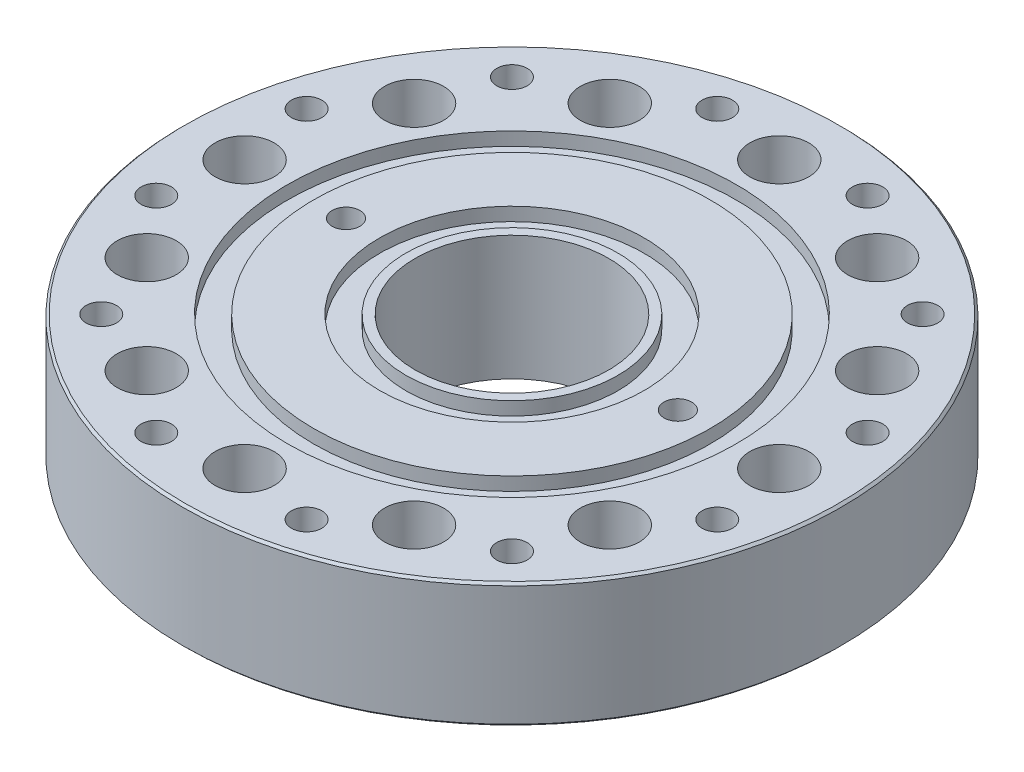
ISO-10303-21;
HEADER;
FILE_DESCRIPTION(('STEP AP214'),'2;1');
FILE_NAME('part.step','',(''),(''),'','','');
FILE_SCHEMA(('AUTOMOTIVE_DESIGN { 1 0 10303 214 1 1 1 1 }'));
ENDSEC;
DATA;
#1=APPLICATION_CONTEXT('core data for automotive mechanical design processes');
#2=APPLICATION_PROTOCOL_DEFINITION('international standard','automotive_design',2000,#1);
#3=PRODUCT_CONTEXT('',#1,'mechanical');
#4=PRODUCT('Part','Part','',(#3));
#5=PRODUCT_RELATED_PRODUCT_CATEGORY('part','',(#4));
#6=PRODUCT_DEFINITION_FORMATION('','',#4);
#7=PRODUCT_DEFINITION_CONTEXT('part definition',#1,'design');
#8=PRODUCT_DEFINITION('design','',#6,#7);
#9=PRODUCT_DEFINITION_SHAPE('','',#8);
#10=(LENGTH_UNIT() NAMED_UNIT(*) SI_UNIT(.MILLI.,.METRE.));
#11=(NAMED_UNIT(*) PLANE_ANGLE_UNIT() SI_UNIT($,.RADIAN.));
#12=(NAMED_UNIT(*) SI_UNIT($,.STERADIAN.) SOLID_ANGLE_UNIT());
#13=UNCERTAINTY_MEASURE_WITH_UNIT(LENGTH_MEASURE(1.E-05),#10,'distance_accuracy_value','');
#14=(GEOMETRIC_REPRESENTATION_CONTEXT(3) GLOBAL_UNCERTAINTY_ASSIGNED_CONTEXT((#13)) GLOBAL_UNIT_ASSIGNED_CONTEXT((#10,
#11,#12)) REPRESENTATION_CONTEXT('',''));
#15=CARTESIAN_POINT('',(0.,0.,0.));
#16=DIRECTION('',(0.,0.,1.));
#17=DIRECTION('',(1.,0.,0.));
#18=AXIS2_PLACEMENT_3D('',#15,#16,#17);
#19=CARTESIAN_POINT('',(18.,-9.,0.));
#20=DIRECTION('',(0.,-1.,0.));
#21=DIRECTION('',(0.,0.,-1.));
#22=AXIS2_PLACEMENT_3D('',#19,#20,#21);
#23=CYLINDRICAL_SURFACE('',#22,1.5);
#24=CARTESIAN_POINT('',(18.,-9.,0.));
#25=DIRECTION('',(0.,-1.,0.));
#26=DIRECTION('',(0.,0.,-1.));
#27=AXIS2_PLACEMENT_3D('',#24,#25,#26);
#28=CIRCLE('',#27,1.5);
#29=CARTESIAN_POINT('',(18.,-9.,-1.5));
#30=VERTEX_POINT('',#29);
#31=EDGE_CURVE('E858',#30,#30,#28,.T.);
#32=ORIENTED_EDGE('',*,*,#31,.F.);
#33=EDGE_LOOP('',(#32));
#34=FACE_BOUND('',#33,.T.);
#35=CARTESIAN_POINT('',(18.,-17.5,0.));
#36=DIRECTION('',(0.,-1.,0.));
#37=DIRECTION('',(0.,0.,-1.));
#38=AXIS2_PLACEMENT_3D('',#35,#36,#37);
#39=CIRCLE('',#38,1.5);
#40=CARTESIAN_POINT('',(18.,-17.5,-1.5));
#41=VERTEX_POINT('',#40);
#42=EDGE_CURVE('E47',#41,#41,#39,.F.);
#43=ORIENTED_EDGE('',*,*,#42,.F.);
#44=EDGE_LOOP('',(#43));
#45=FACE_BOUND('',#44,.T.);
#46=ADVANCED_FACE('F43',(#34,#45),#23,.F.);
#47=CARTESIAN_POINT('',(-18.,-9.,0.));
#48=DIRECTION('',(0.,-1.,0.));
#49=DIRECTION('',(0.,0.,-1.));
#50=AXIS2_PLACEMENT_3D('',#47,#48,#49);
#51=CYLINDRICAL_SURFACE('',#50,1.5);
#52=CARTESIAN_POINT('',(-18.,-9.,0.));
#53=DIRECTION('',(0.,-1.,0.));
#54=DIRECTION('',(0.,0.,-1.));
#55=AXIS2_PLACEMENT_3D('',#52,#53,#54);
#56=CIRCLE('',#55,1.5);
#57=CARTESIAN_POINT('',(-18.,-9.,-1.5));
#58=VERTEX_POINT('',#57);
#59=EDGE_CURVE('E638',#58,#58,#56,.T.);
#60=ORIENTED_EDGE('',*,*,#59,.F.);
#61=EDGE_LOOP('',(#60));
#62=FACE_BOUND('',#61,.T.);
#63=CARTESIAN_POINT('',(-18.,-17.5,0.));
#64=DIRECTION('',(0.,-1.,0.));
#65=DIRECTION('',(0.,0.,-1.));
#66=AXIS2_PLACEMENT_3D('',#63,#64,#65);
#67=CIRCLE('',#66,1.5);
#68=CARTESIAN_POINT('',(-18.,-17.5,-1.5));
#69=VERTEX_POINT('',#68);
#70=EDGE_CURVE('E852',#69,#69,#67,.F.);
#71=ORIENTED_EDGE('',*,*,#70,.F.);
#72=EDGE_LOOP('',(#71));
#73=FACE_BOUND('',#72,.T.);
#74=ADVANCED_FACE('F1001',(#62,#73),#51,.F.);
#75=CARTESIAN_POINT('',(0.,-10.45,0.));
#76=DIRECTION('',(0.,1.,0.));
#77=DIRECTION('',(0.,0.,1.));
#78=AXIS2_PLACEMENT_3D('',#75,#76,#77);
#79=CYLINDRICAL_SURFACE('',#78,14.35);
#80=DIRECTION('',(0.,1.,0.));
#81=VECTOR('',#80,1.);
#82=CARTESIAN_POINT('',(0.,-10.45,14.35));
#83=LINE('',#82,#81);
#84=CARTESIAN_POINT('',(0.,-10.45,14.35));
#85=VERTEX_POINT('',#84);
#86=CARTESIAN_POINT('',(0.,-9.,14.35));
#87=VERTEX_POINT('',#86);
#88=EDGE_CURVE('E11',#85,#87,#83,.T.);
#89=ORIENTED_EDGE('',*,*,#88,.F.);
#90=CARTESIAN_POINT('',(0.,-10.45,0.));
#91=DIRECTION('',(0.,1.,0.));
#92=DIRECTION('',(0.,0.,1.));
#93=AXIS2_PLACEMENT_3D('',#90,#91,#92);
#94=CIRCLE('',#93,14.35);
#95=EDGE_CURVE('E54',#85,#85,#94,.T.);
#96=ORIENTED_EDGE('',*,*,#95,.F.);
#97=ORIENTED_EDGE('',*,*,#88,.T.);
#98=CARTESIAN_POINT('',(0.,-9.,0.));
#99=DIRECTION('',(0.,1.,0.));
#100=DIRECTION('',(0.,0.,1.));
#101=AXIS2_PLACEMENT_3D('',#98,#99,#100);
#102=CIRCLE('',#101,14.35);
#103=EDGE_CURVE('E692',#87,#87,#102,.T.);
#104=ORIENTED_EDGE('',*,*,#103,.T.);
#105=EDGE_LOOP('',(#89,#96,#97,#104));
#106=FACE_BOUND('',#105,.T.);
#107=ADVANCED_FACE('F1007',(#106),#79,.F.);
#108=CARTESIAN_POINT('',(0.,-10.45,0.));
#109=DIRECTION('',(0.,1.,0.));
#110=DIRECTION('',(0.,0.,-1.));
#111=AXIS2_PLACEMENT_3D('',#108,#109,#110);
#112=PLANE('',#111);
#113=CARTESIAN_POINT('',(0.,-10.45,0.));
#114=DIRECTION('',(0.,1.,0.));
#115=DIRECTION('',(0.,0.,1.));
#116=AXIS2_PLACEMENT_3D('',#113,#114,#115);
#117=CIRCLE('',#116,11.5);
#118=CARTESIAN_POINT('',(0.,-10.45,11.5));
#119=VERTEX_POINT('',#118);
#120=EDGE_CURVE('E409',#119,#119,#117,.T.);
#121=ORIENTED_EDGE('',*,*,#120,.F.);
#122=EDGE_LOOP('',(#121));
#123=FACE_BOUND('',#122,.T.);
#124=ORIENTED_EDGE('',*,*,#95,.T.);
#125=EDGE_LOOP('',(#124));
#126=FACE_BOUND('',#125,.T.);
#127=ADVANCED_FACE('F1095',(#123,#126),#112,.T.);
#128=CARTESIAN_POINT('',(0.,-9.,0.));
#129=DIRECTION('',(0.,1.,0.));
#130=DIRECTION('',(0.,0.,-1.));
#131=AXIS2_PLACEMENT_3D('',#128,#129,#130);
#132=PLANE('',#131);
#133=ORIENTED_EDGE('',*,*,#59,.T.);
#134=EDGE_LOOP('',(#133));
#135=FACE_BOUND('',#134,.T.);
#136=ORIENTED_EDGE('',*,*,#31,.T.);
#137=EDGE_LOOP('',(#136));
#138=FACE_BOUND('',#137,.T.);
#139=ORIENTED_EDGE('',*,*,#103,.F.);
#140=EDGE_LOOP('',(#139));
#141=FACE_BOUND('',#140,.T.);
#142=CARTESIAN_POINT('',(0.,-9.,0.));
#143=DIRECTION('',(0.,1.,0.));
#144=DIRECTION('',(0.,0.,1.));
#145=AXIS2_PLACEMENT_3D('',#142,#143,#144);
#146=CIRCLE('',#145,21.5);
#147=CARTESIAN_POINT('',(0.,-9.,21.5));
#148=VERTEX_POINT('',#147);
#149=EDGE_CURVE('E416',#148,#148,#146,.T.);
#150=ORIENTED_EDGE('',*,*,#149,.T.);
#151=EDGE_LOOP('',(#150));
#152=FACE_BOUND('',#151,.T.);
#153=ADVANCED_FACE('F1185',(#135,#138,#141,#152),#132,.T.);
#154=CARTESIAN_POINT('',(0.,-10.46,0.));
#155=DIRECTION('',(0.,1.,0.));
#156=DIRECTION('',(0.,0.,1.));
#157=AXIS2_PLACEMENT_3D('',#154,#155,#156);
#158=CYLINDRICAL_SURFACE('',#157,11.5);
#159=CARTESIAN_POINT('',(0.,-9.,0.));
#160=DIRECTION('',(0.,1.,0.));
#161=DIRECTION('',(0.,0.,1.));
#162=AXIS2_PLACEMENT_3D('',#159,#160,#161);
#163=CIRCLE('',#162,11.5);
#164=CARTESIAN_POINT('',(0.,-9.,11.5));
#165=VERTEX_POINT('',#164);
#166=EDGE_CURVE('E407',#165,#165,#163,.T.);
#167=ORIENTED_EDGE('',*,*,#166,.F.);
#168=DIRECTION('',(0.,1.,0.));
#169=VECTOR('',#168,1.);
#170=CARTESIAN_POINT('',(0.,-10.46,11.5));
#171=LINE('',#170,#169);
#172=EDGE_CURVE('E404',#119,#165,#171,.T.);
#173=ORIENTED_EDGE('',*,*,#172,.F.);
#174=ORIENTED_EDGE('',*,*,#120,.T.);
#175=ORIENTED_EDGE('',*,*,#172,.T.);
#176=EDGE_LOOP('',(#167,#173,#174,#175));
#177=FACE_BOUND('',#176,.T.);
#178=ADVANCED_FACE('F406',(#177),#158,.T.);
#179=CARTESIAN_POINT('',(0.,-10.46,0.));
#180=DIRECTION('',(0.,1.,0.));
#181=DIRECTION('',(0.,0.,1.));
#182=AXIS2_PLACEMENT_3D('',#179,#180,#181);
#183=CYLINDRICAL_SURFACE('',#182,21.5);
#184=ORIENTED_EDGE('',*,*,#149,.F.);
#185=DIRECTION('',(0.,1.,0.));
#186=VECTOR('',#185,1.);
#187=CARTESIAN_POINT('',(0.,-10.46,21.5));
#188=LINE('',#187,#186);
#189=CARTESIAN_POINT('',(0.,-10.45,21.5));
#190=VERTEX_POINT('',#189);
#191=EDGE_CURVE('E411',#190,#148,#188,.T.);
#192=ORIENTED_EDGE('',*,*,#191,.F.);
#193=CARTESIAN_POINT('',(0.,-10.45,0.));
#194=DIRECTION('',(0.,1.,0.));
#195=DIRECTION('',(0.,0.,1.));
#196=AXIS2_PLACEMENT_3D('',#193,#194,#195);
#197=CIRCLE('',#196,21.5);
#198=EDGE_CURVE('E417',#190,#190,#197,.T.);
#199=ORIENTED_EDGE('',*,*,#198,.T.);
#200=ORIENTED_EDGE('',*,*,#191,.T.);
#201=EDGE_LOOP('',(#184,#192,#199,#200));
#202=FACE_BOUND('',#201,.T.);
#203=ADVANCED_FACE('F1023',(#202),#183,.T.);
#204=CARTESIAN_POINT('',(0.,-14.5,13.55));
#205=DIRECTION('',(0.,1.,0.));
#206=DIRECTION('',(0.,0.,-1.));
#207=AXIS2_PLACEMENT_3D('',#204,#205,#206);
#208=PLANE('',#207);
#209=CARTESIAN_POINT('',(0.,-14.5,13.55));
#210=DIRECTION('',(0.,1.,0.));
#211=DIRECTION('',(0.,0.,1.));
#212=AXIS2_PLACEMENT_3D('',#209,#210,#211);
#213=CIRCLE('',#212,1.666);
#214=CARTESIAN_POINT('',(0.,-14.5,15.216));
#215=VERTEX_POINT('',#214);
#216=EDGE_CURVE('E548',#215,#215,#213,.T.);
#217=ORIENTED_EDGE('',*,*,#216,.F.);
#218=EDGE_LOOP('',(#217));
#219=FACE_BOUND('',#218,.T.);
#220=ADVANCED_FACE('F1020',(#219),#208,.F.);
#221=CARTESIAN_POINT('',(0.,-9.,0.));
#222=DIRECTION('',(0.,1.,0.));
#223=DIRECTION('',(0.,0.,-1.));
#224=AXIS2_PLACEMENT_3D('',#221,#222,#223);
#225=PLANE('',#224);
#226=CARTESIAN_POINT('',(0.,-9.,0.));
#227=DIRECTION('',(0.,1.,0.));
#228=DIRECTION('',(0.,0.,1.));
#229=AXIS2_PLACEMENT_3D('',#226,#227,#228);
#230=CIRCLE('',#229,10.5);
#231=CARTESIAN_POINT('',(0.,-9.,10.5));
#232=VERTEX_POINT('',#231);
#233=EDGE_CURVE('E577',#232,#232,#230,.T.);
#234=ORIENTED_EDGE('',*,*,#233,.F.);
#235=EDGE_LOOP('',(#234));
#236=FACE_BOUND('',#235,.T.);
#237=ORIENTED_EDGE('',*,*,#166,.T.);
#238=EDGE_LOOP('',(#237));
#239=FACE_BOUND('',#238,.T.);
#240=ADVANCED_FACE('F414',(#236,#239),#225,.T.);
#241=CARTESIAN_POINT('',(0.,-14.5,-13.55));
#242=DIRECTION('',(0.,1.,0.));
#243=DIRECTION('',(0.,0.,-1.));
#244=AXIS2_PLACEMENT_3D('',#241,#242,#243);
#245=PLANE('',#244);
#246=CARTESIAN_POINT('',(0.,-14.5,-13.55));
#247=DIRECTION('',(0.,1.,0.));
#248=DIRECTION('',(0.,0.,1.));
#249=AXIS2_PLACEMENT_3D('',#246,#247,#248);
#250=CIRCLE('',#249,1.666);
#251=CARTESIAN_POINT('',(0.,-14.5,-11.884));
#252=VERTEX_POINT('',#251);
#253=EDGE_CURVE('E748',#252,#252,#250,.T.);
#254=ORIENTED_EDGE('',*,*,#253,.F.);
#255=EDGE_LOOP('',(#254));
#256=FACE_BOUND('',#255,.T.);
#257=ADVANCED_FACE('F1105',(#256),#245,.F.);
#258=CARTESIAN_POINT('',(22.273863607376,-18.5,22.273863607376));
#259=DIRECTION('',(0.,1.,0.));
#260=DIRECTION('',(0.,0.,-1.));
#261=AXIS2_PLACEMENT_3D('',#258,#259,#260);
#262=PLANE('',#261);
#263=CARTESIAN_POINT('',(22.273863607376,-18.5,22.273863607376));
#264=DIRECTION('',(0.,1.,0.));
#265=DIRECTION('',(0.,0.,1.));
#266=AXIS2_PLACEMENT_3D('',#263,#264,#265);
#267=CIRCLE('',#266,1.65);
#268=CARTESIAN_POINT('',(22.273863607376,-18.5,23.923863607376));
#269=VERTEX_POINT('',#268);
#270=EDGE_CURVE('E448',#269,#269,#267,.T.);
#271=ORIENTED_EDGE('',*,*,#270,.T.);
#272=EDGE_LOOP('',(#271));
#273=FACE_BOUND('',#272,.T.);
#274=CARTESIAN_POINT('',(22.273863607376,-18.5,22.273863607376));
#275=DIRECTION('',(0.,1.,0.));
#276=DIRECTION('',(0.,0.,1.));
#277=AXIS2_PLACEMENT_3D('',#274,#275,#276);
#278=CIRCLE('',#277,2.85);
#279=CARTESIAN_POINT('',(22.273863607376,-18.5,25.123863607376));
#280=VERTEX_POINT('',#279);
#281=EDGE_CURVE('E427',#280,#280,#278,.T.);
#282=ORIENTED_EDGE('',*,*,#281,.F.);
#283=EDGE_LOOP('',(#282));
#284=FACE_BOUND('',#283,.T.);
#285=ADVANCED_FACE('F1127',(#273,#284),#262,.F.);
#286=CARTESIAN_POINT('',(30.426663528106,-18.5,8.152799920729));
#287=DIRECTION('',(0.,1.,0.));
#288=DIRECTION('',(0.,0.,-1.));
#289=AXIS2_PLACEMENT_3D('',#286,#287,#288);
#290=PLANE('',#289);
#291=CARTESIAN_POINT('',(30.426663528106,-18.5,8.152799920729));
#292=DIRECTION('',(0.,1.,0.));
#293=DIRECTION('',(0.,0.,1.));
#294=AXIS2_PLACEMENT_3D('',#291,#292,#293);
#295=CIRCLE('',#294,1.65);
#296=CARTESIAN_POINT('',(30.426663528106,-18.5,9.802799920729));
#297=VERTEX_POINT('',#296);
#298=EDGE_CURVE('E564',#297,#297,#295,.T.);
#299=ORIENTED_EDGE('',*,*,#298,.T.);
#300=EDGE_LOOP('',(#299));
#301=FACE_BOUND('',#300,.T.);
#302=CARTESIAN_POINT('',(30.426663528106,-18.5,8.152799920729));
#303=DIRECTION('',(0.,1.,0.));
#304=DIRECTION('',(0.,0.,1.));
#305=AXIS2_PLACEMENT_3D('',#302,#303,#304);
#306=CIRCLE('',#305,2.85);
#307=CARTESIAN_POINT('',(30.426663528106,-18.5,11.002799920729));
#308=VERTEX_POINT('',#307);
#309=EDGE_CURVE('E757',#308,#308,#306,.T.);
#310=ORIENTED_EDGE('',*,*,#309,.F.);
#311=EDGE_LOOP('',(#310));
#312=FACE_BOUND('',#311,.T.);
#313=ADVANCED_FACE('F1018',(#301,#312),#290,.F.);
#314=CARTESIAN_POINT('',(8.152799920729,-18.5,30.426663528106));
#315=DIRECTION('',(0.,1.,0.));
#316=DIRECTION('',(0.,0.,-1.));
#317=AXIS2_PLACEMENT_3D('',#314,#315,#316);
#318=PLANE('',#317);
#319=CARTESIAN_POINT('',(8.152799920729,-18.5,30.426663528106));
#320=DIRECTION('',(0.,1.,0.));
#321=DIRECTION('',(0.,0.,1.));
#322=AXIS2_PLACEMENT_3D('',#319,#320,#321);
#323=CIRCLE('',#322,1.65);
#324=CARTESIAN_POINT('',(8.152799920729,-18.5,32.076663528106));
#325=VERTEX_POINT('',#324);
#326=EDGE_CURVE('E478',#325,#325,#323,.T.);
#327=ORIENTED_EDGE('',*,*,#326,.T.);
#328=EDGE_LOOP('',(#327));
#329=FACE_BOUND('',#328,.T.);
#330=CARTESIAN_POINT('',(8.152799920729,-18.5,30.426663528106));
#331=DIRECTION('',(0.,1.,0.));
#332=DIRECTION('',(0.,0.,1.));
#333=AXIS2_PLACEMENT_3D('',#330,#331,#332);
#334=CIRCLE('',#333,2.85);
#335=CARTESIAN_POINT('',(8.152799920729,-18.5,33.276663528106));
#336=VERTEX_POINT('',#335);
#337=EDGE_CURVE('E593',#336,#336,#334,.T.);
#338=ORIENTED_EDGE('',*,*,#337,.F.);
#339=EDGE_LOOP('',(#338));
#340=FACE_BOUND('',#339,.T.);
#341=ADVANCED_FACE('F1014',(#329,#340),#318,.F.);
#342=CARTESIAN_POINT('',(0.,-10.45,0.));
#343=DIRECTION('',(0.,1.,0.));
#344=DIRECTION('',(0.,0.,-1.));
#345=AXIS2_PLACEMENT_3D('',#342,#343,#344);
#346=PLANE('',#345);
#347=ORIENTED_EDGE('',*,*,#198,.F.);
#348=EDGE_LOOP('',(#347));
#349=FACE_BOUND('',#348,.T.);
#350=CARTESIAN_POINT('',(0.,-10.45,0.));
#351=DIRECTION('',(0.,1.,0.));
#352=DIRECTION('',(0.,0.,1.));
#353=AXIS2_PLACEMENT_3D('',#350,#351,#352);
#354=CIRCLE('',#353,24.35);
#355=CARTESIAN_POINT('',(0.,-10.45,24.35));
#356=VERTEX_POINT('',#355);
#357=EDGE_CURVE('E371',#356,#356,#354,.T.);
#358=ORIENTED_EDGE('',*,*,#357,.T.);
#359=EDGE_LOOP('',(#358));
#360=FACE_BOUND('',#359,.T.);
#361=ADVANCED_FACE('F1017',(#349,#360),#346,.T.);
#362=CARTESIAN_POINT('',(30.426663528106,-18.5,-8.152799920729));
#363=DIRECTION('',(0.,1.,0.));
#364=DIRECTION('',(0.,0.,-1.));
#365=AXIS2_PLACEMENT_3D('',#362,#363,#364);
#366=PLANE('',#365);
#367=CARTESIAN_POINT('',(30.426663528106,-18.5,-8.152799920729));
#368=DIRECTION('',(0.,1.,0.));
#369=DIRECTION('',(0.,0.,1.));
#370=AXIS2_PLACEMENT_3D('',#367,#368,#369);
#371=CIRCLE('',#370,1.65);
#372=CARTESIAN_POINT('',(30.426663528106,-18.5,-6.502799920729));
#373=VERTEX_POINT('',#372);
#374=EDGE_CURVE('E362',#373,#373,#371,.T.);
#375=ORIENTED_EDGE('',*,*,#374,.T.);
#376=EDGE_LOOP('',(#375));
#377=FACE_BOUND('',#376,.T.);
#378=CARTESIAN_POINT('',(30.426663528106,-18.5,-8.152799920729));
#379=DIRECTION('',(0.,1.,0.));
#380=DIRECTION('',(0.,0.,1.));
#381=AXIS2_PLACEMENT_3D('',#378,#379,#380);
#382=CIRCLE('',#381,2.85);
#383=CARTESIAN_POINT('',(30.426663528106,-18.5,-5.302799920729));
#384=VERTEX_POINT('',#383);
#385=EDGE_CURVE('E789',#384,#384,#382,.T.);
#386=ORIENTED_EDGE('',*,*,#385,.F.);
#387=EDGE_LOOP('',(#386));
#388=FACE_BOUND('',#387,.T.);
#389=ADVANCED_FACE('F1044',(#377,#388),#366,.F.);
#390=CARTESIAN_POINT('',(22.273863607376,-18.5,-22.27386360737));
#391=DIRECTION('',(0.,1.,0.));
#392=DIRECTION('',(0.,0.,-1.));
#393=AXIS2_PLACEMENT_3D('',#390,#391,#392);
#394=PLANE('',#393);
#395=CARTESIAN_POINT('',(22.273863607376,-18.5,-22.27386360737));
#396=DIRECTION('',(0.,1.,0.));
#397=DIRECTION('',(0.,0.,1.));
#398=AXIS2_PLACEMENT_3D('',#395,#396,#397);
#399=CIRCLE('',#398,1.65);
#400=CARTESIAN_POINT('',(22.273863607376,-18.5,-20.62386360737));
#401=VERTEX_POINT('',#400);
#402=EDGE_CURVE('E601',#401,#401,#399,.T.);
#403=ORIENTED_EDGE('',*,*,#402,.T.);
#404=EDGE_LOOP('',(#403));
#405=FACE_BOUND('',#404,.T.);
#406=CARTESIAN_POINT('',(22.273863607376,-18.5,-22.27386360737));
#407=DIRECTION('',(0.,1.,0.));
#408=DIRECTION('',(0.,0.,1.));
#409=AXIS2_PLACEMENT_3D('',#406,#407,#408);
#410=CIRCLE('',#409,2.85);
#411=CARTESIAN_POINT('',(22.273863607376,-18.5,-19.42386360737));
#412=VERTEX_POINT('',#411);
#413=EDGE_CURVE('E749',#412,#412,#410,.T.);
#414=ORIENTED_EDGE('',*,*,#413,.F.);
#415=EDGE_LOOP('',(#414));
#416=FACE_BOUND('',#415,.T.);
#417=ADVANCED_FACE('F1176',(#405,#416),#394,.F.);
#418=CARTESIAN_POINT('',(8.152799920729,-18.5,-30.4266635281));
#419=DIRECTION('',(0.,1.,0.));
#420=DIRECTION('',(0.,0.,-1.));
#421=AXIS2_PLACEMENT_3D('',#418,#419,#420);
#422=PLANE('',#421);
#423=CARTESIAN_POINT('',(8.152799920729,-18.5,-30.4266635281));
#424=DIRECTION('',(0.,1.,0.));
#425=DIRECTION('',(0.,0.,1.));
#426=AXIS2_PLACEMENT_3D('',#423,#424,#425);
#427=CIRCLE('',#426,1.65);
#428=CARTESIAN_POINT('',(8.152799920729,-18.5,-28.7766635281));
#429=VERTEX_POINT('',#428);
#430=EDGE_CURVE('E499',#429,#429,#427,.T.);
#431=ORIENTED_EDGE('',*,*,#430,.T.);
#432=EDGE_LOOP('',(#431));
#433=FACE_BOUND('',#432,.T.);
#434=CARTESIAN_POINT('',(8.152799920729,-18.5,-30.4266635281));
#435=DIRECTION('',(0.,1.,0.));
#436=DIRECTION('',(0.,0.,1.));
#437=AXIS2_PLACEMENT_3D('',#434,#435,#436);
#438=CIRCLE('',#437,2.85);
#439=CARTESIAN_POINT('',(8.152799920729,-18.5,-27.5766635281));
#440=VERTEX_POINT('',#439);
#441=EDGE_CURVE('E679',#440,#440,#438,.T.);
#442=ORIENTED_EDGE('',*,*,#441,.F.);
#443=EDGE_LOOP('',(#442));
#444=FACE_BOUND('',#443,.T.);
#445=ADVANCED_FACE('F1168',(#433,#444),#422,.F.);
#446=CARTESIAN_POINT('',(-8.152799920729,-18.5,30.426663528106));
#447=DIRECTION('',(0.,1.,0.));
#448=DIRECTION('',(0.,0.,-1.));
#449=AXIS2_PLACEMENT_3D('',#446,#447,#448);
#450=PLANE('',#449);
#451=CARTESIAN_POINT('',(-8.152799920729,-18.5,30.426663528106));
#452=DIRECTION('',(0.,1.,0.));
#453=DIRECTION('',(0.,0.,1.));
#454=AXIS2_PLACEMENT_3D('',#451,#452,#453);
#455=CIRCLE('',#454,1.65);
#456=CARTESIAN_POINT('',(-8.152799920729,-18.5,32.076663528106));
#457=VERTEX_POINT('',#456);
#458=EDGE_CURVE('E433',#457,#457,#455,.T.);
#459=ORIENTED_EDGE('',*,*,#458,.T.);
#460=EDGE_LOOP('',(#459));
#461=FACE_BOUND('',#460,.T.);
#462=CARTESIAN_POINT('',(-8.152799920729,-18.5,30.426663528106));
#463=DIRECTION('',(0.,1.,0.));
#464=DIRECTION('',(0.,0.,1.));
#465=AXIS2_PLACEMENT_3D('',#462,#463,#464);
#466=CIRCLE('',#465,2.85);
#467=CARTESIAN_POINT('',(-8.152799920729,-18.5,33.276663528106));
#468=VERTEX_POINT('',#467);
#469=EDGE_CURVE('E533',#468,#468,#466,.T.);
#470=ORIENTED_EDGE('',*,*,#469,.F.);
#471=EDGE_LOOP('',(#470));
#472=FACE_BOUND('',#471,.T.);
#473=ADVANCED_FACE('F1164',(#461,#472),#450,.F.);
#474=CARTESIAN_POINT('',(-22.27386360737,-18.5,22.273863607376));
#475=DIRECTION('',(0.,1.,0.));
#476=DIRECTION('',(0.,0.,-1.));
#477=AXIS2_PLACEMENT_3D('',#474,#475,#476);
#478=PLANE('',#477);
#479=CARTESIAN_POINT('',(-22.27386360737,-18.5,22.273863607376));
#480=DIRECTION('',(0.,1.,0.));
#481=DIRECTION('',(0.,0.,1.));
#482=AXIS2_PLACEMENT_3D('',#479,#480,#481);
#483=CIRCLE('',#482,1.65);
#484=CARTESIAN_POINT('',(-22.27386360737,-18.5,23.923863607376));
#485=VERTEX_POINT('',#484);
#486=EDGE_CURVE('E513',#485,#485,#483,.T.);
#487=ORIENTED_EDGE('',*,*,#486,.T.);
#488=EDGE_LOOP('',(#487));
#489=FACE_BOUND('',#488,.T.);
#490=CARTESIAN_POINT('',(-22.27386360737,-18.5,22.273863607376));
#491=DIRECTION('',(0.,1.,0.));
#492=DIRECTION('',(0.,0.,1.));
#493=AXIS2_PLACEMENT_3D('',#490,#491,#492);
#494=CIRCLE('',#493,2.85);
#495=CARTESIAN_POINT('',(-22.27386360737,-18.5,25.123863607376));
#496=VERTEX_POINT('',#495);
#497=EDGE_CURVE('E526',#496,#496,#494,.T.);
#498=ORIENTED_EDGE('',*,*,#497,.F.);
#499=EDGE_LOOP('',(#498));
#500=FACE_BOUND('',#499,.T.);
#501=ADVANCED_FACE('F1167',(#489,#500),#478,.F.);
#502=CARTESIAN_POINT('',(-30.4266635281,-18.5,8.152799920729));
#503=DIRECTION('',(0.,1.,0.));
#504=DIRECTION('',(0.,0.,-1.));
#505=AXIS2_PLACEMENT_3D('',#502,#503,#504);
#506=PLANE('',#505);
#507=CARTESIAN_POINT('',(-30.4266635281,-18.5,8.152799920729));
#508=DIRECTION('',(0.,1.,0.));
#509=DIRECTION('',(0.,0.,1.));
#510=AXIS2_PLACEMENT_3D('',#507,#508,#509);
#511=CIRCLE('',#510,1.65);
#512=CARTESIAN_POINT('',(-30.4266635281,-18.5,9.802799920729));
#513=VERTEX_POINT('',#512);
#514=EDGE_CURVE('E488',#513,#513,#511,.T.);
#515=ORIENTED_EDGE('',*,*,#514,.T.);
#516=EDGE_LOOP('',(#515));
#517=FACE_BOUND('',#516,.T.);
#518=CARTESIAN_POINT('',(-30.4266635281,-18.5,8.152799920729));
#519=DIRECTION('',(0.,1.,0.));
#520=DIRECTION('',(0.,0.,1.));
#521=AXIS2_PLACEMENT_3D('',#518,#519,#520);
#522=CIRCLE('',#521,2.85);
#523=CARTESIAN_POINT('',(-30.4266635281,-18.5,11.002799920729));
#524=VERTEX_POINT('',#523);
#525=EDGE_CURVE('E527',#524,#524,#522,.T.);
#526=ORIENTED_EDGE('',*,*,#525,.F.);
#527=EDGE_LOOP('',(#526));
#528=FACE_BOUND('',#527,.T.);
#529=ADVANCED_FACE('F1050',(#517,#528),#506,.F.);
#530=CARTESIAN_POINT('',(-8.152799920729,-18.5,-30.4266635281));
#531=DIRECTION('',(0.,1.,0.));
#532=DIRECTION('',(0.,0.,-1.));
#533=AXIS2_PLACEMENT_3D('',#530,#531,#532);
#534=PLANE('',#533);
#535=CARTESIAN_POINT('',(-8.152799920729,-18.5,-30.4266635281));
#536=DIRECTION('',(0.,1.,0.));
#537=DIRECTION('',(0.,0.,1.));
#538=AXIS2_PLACEMENT_3D('',#535,#536,#537);
#539=CIRCLE('',#538,1.65);
#540=CARTESIAN_POINT('',(-8.152799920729,-18.5,-28.7766635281));
#541=VERTEX_POINT('',#540);
#542=EDGE_CURVE('E431',#541,#541,#539,.T.);
#543=ORIENTED_EDGE('',*,*,#542,.T.);
#544=EDGE_LOOP('',(#543));
#545=FACE_BOUND('',#544,.T.);
#546=CARTESIAN_POINT('',(-8.152799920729,-18.5,-30.4266635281));
#547=DIRECTION('',(0.,1.,0.));
#548=DIRECTION('',(0.,0.,1.));
#549=AXIS2_PLACEMENT_3D('',#546,#547,#548);
#550=CIRCLE('',#549,2.85);
#551=CARTESIAN_POINT('',(-8.152799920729,-18.5,-27.5766635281));
#552=VERTEX_POINT('',#551);
#553=EDGE_CURVE('E605',#552,#552,#550,.T.);
#554=ORIENTED_EDGE('',*,*,#553,.F.);
#555=EDGE_LOOP('',(#554));
#556=FACE_BOUND('',#555,.T.);
#557=ADVANCED_FACE('F1046',(#545,#556),#534,.F.);
#558=CARTESIAN_POINT('',(-30.4266635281,-18.5,-8.152799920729));
#559=DIRECTION('',(0.,1.,0.));
#560=DIRECTION('',(0.,0.,-1.));
#561=AXIS2_PLACEMENT_3D('',#558,#559,#560);
#562=PLANE('',#561);
#563=CARTESIAN_POINT('',(-30.4266635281,-18.5,-8.152799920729));
#564=DIRECTION('',(0.,1.,0.));
#565=DIRECTION('',(0.,0.,1.));
#566=AXIS2_PLACEMENT_3D('',#563,#564,#565);
#567=CIRCLE('',#566,1.65);
#568=CARTESIAN_POINT('',(-30.4266635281,-18.5,-6.502799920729));
#569=VERTEX_POINT('',#568);
#570=EDGE_CURVE('E624',#569,#569,#567,.T.);
#571=ORIENTED_EDGE('',*,*,#570,.T.);
#572=EDGE_LOOP('',(#571));
#573=FACE_BOUND('',#572,.T.);
#574=CARTESIAN_POINT('',(-30.4266635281,-18.5,-8.152799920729));
#575=DIRECTION('',(0.,1.,0.));
#576=DIRECTION('',(0.,0.,1.));
#577=AXIS2_PLACEMENT_3D('',#574,#575,#576);
#578=CIRCLE('',#577,2.85);
#579=CARTESIAN_POINT('',(-30.4266635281,-18.5,-5.302799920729));
#580=VERTEX_POINT('',#579);
#581=EDGE_CURVE('E653',#580,#580,#578,.T.);
#582=ORIENTED_EDGE('',*,*,#581,.F.);
#583=EDGE_LOOP('',(#582));
#584=FACE_BOUND('',#583,.T.);
#585=ADVANCED_FACE('F1049',(#573,#584),#562,.F.);
#586=CARTESIAN_POINT('',(-22.27386360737,-18.5,-22.27386360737));
#587=DIRECTION('',(0.,1.,0.));
#588=DIRECTION('',(0.,0.,-1.));
#589=AXIS2_PLACEMENT_3D('',#586,#587,#588);
#590=PLANE('',#589);
#591=CARTESIAN_POINT('',(-22.27386360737,-18.5,-22.27386360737));
#592=DIRECTION('',(0.,1.,0.));
#593=DIRECTION('',(0.,0.,1.));
#594=AXIS2_PLACEMENT_3D('',#591,#592,#593);
#595=CIRCLE('',#594,1.65);
#596=CARTESIAN_POINT('',(-22.27386360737,-18.5,-20.62386360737));
#597=VERTEX_POINT('',#596);
#598=EDGE_CURVE('E625',#597,#597,#595,.T.);
#599=ORIENTED_EDGE('',*,*,#598,.T.);
#600=EDGE_LOOP('',(#599));
#601=FACE_BOUND('',#600,.T.);
#602=CARTESIAN_POINT('',(-22.27386360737,-18.5,-22.27386360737));
#603=DIRECTION('',(0.,1.,0.));
#604=DIRECTION('',(0.,0.,1.));
#605=AXIS2_PLACEMENT_3D('',#602,#603,#604);
#606=CIRCLE('',#605,2.85);
#607=CARTESIAN_POINT('',(-22.27386360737,-18.5,-19.42386360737));
#608=VERTEX_POINT('',#607);
#609=EDGE_CURVE('E447',#608,#608,#606,.T.);
#610=ORIENTED_EDGE('',*,*,#609,.F.);
#611=EDGE_LOOP('',(#610));
#612=FACE_BOUND('',#611,.T.);
#613=ADVANCED_FACE('F1057',(#601,#612),#590,.F.);
#614=CARTESIAN_POINT('',(22.273863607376,-22.6,22.273863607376));
#615=DIRECTION('',(0.,1.,0.));
#616=DIRECTION('',(0.,0.,1.));
#617=AXIS2_PLACEMENT_3D('',#614,#615,#616);
#618=CYLINDRICAL_SURFACE('',#617,2.85);
#619=CARTESIAN_POINT('',(22.273863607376,-22.5,22.273863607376));
#620=DIRECTION('',(0.,1.,0.));
#621=DIRECTION('',(0.,0.,1.));
#622=AXIS2_PLACEMENT_3D('',#619,#620,#621);
#623=CIRCLE('',#622,2.85);
#624=CARTESIAN_POINT('',(22.273863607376,-22.5,25.123863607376));
#625=VERTEX_POINT('',#624);
#626=EDGE_CURVE('E542',#625,#625,#623,.T.);
#627=ORIENTED_EDGE('',*,*,#626,.F.);
#628=DIRECTION('',(0.,1.,0.));
#629=VECTOR('',#628,1.);
#630=CARTESIAN_POINT('',(22.273863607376,-22.6,25.123863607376));
#631=LINE('',#630,#629);
#632=EDGE_CURVE('E484',#625,#280,#631,.T.);
#633=ORIENTED_EDGE('',*,*,#632,.T.);
#634=ORIENTED_EDGE('',*,*,#281,.T.);
#635=ORIENTED_EDGE('',*,*,#632,.F.);
#636=EDGE_LOOP('',(#627,#633,#634,#635));
#637=FACE_BOUND('',#636,.T.);
#638=ADVANCED_FACE('F1060',(#637),#618,.F.);
#639=CARTESIAN_POINT('',(30.426663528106,-22.6,8.152799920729));
#640=DIRECTION('',(0.,1.,0.));
#641=DIRECTION('',(0.,0.,1.));
#642=AXIS2_PLACEMENT_3D('',#639,#640,#641);
#643=CYLINDRICAL_SURFACE('',#642,2.85);
#644=CARTESIAN_POINT('',(30.426663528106,-22.5,8.152799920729));
#645=DIRECTION('',(0.,1.,0.));
#646=DIRECTION('',(0.,0.,1.));
#647=AXIS2_PLACEMENT_3D('',#644,#645,#646);
#648=CIRCLE('',#647,2.85);
#649=CARTESIAN_POINT('',(30.426663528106,-22.5,11.002799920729));
#650=VERTEX_POINT('',#649);
#651=EDGE_CURVE('E494',#650,#650,#648,.T.);
#652=ORIENTED_EDGE('',*,*,#651,.F.);
#653=DIRECTION('',(0.,1.,0.));
#654=VECTOR('',#653,1.);
#655=CARTESIAN_POINT('',(30.426663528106,-22.6,11.002799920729));
#656=LINE('',#655,#654);
#657=EDGE_CURVE('E760',#650,#308,#656,.T.);
#658=ORIENTED_EDGE('',*,*,#657,.T.);
#659=ORIENTED_EDGE('',*,*,#309,.T.);
#660=ORIENTED_EDGE('',*,*,#657,.F.);
#661=EDGE_LOOP('',(#652,#658,#659,#660));
#662=FACE_BOUND('',#661,.T.);
#663=ADVANCED_FACE('F1066',(#662),#643,.F.);
#664=CARTESIAN_POINT('',(8.152799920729,-22.6,30.426663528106));
#665=DIRECTION('',(0.,1.,0.));
#666=DIRECTION('',(0.,0.,1.));
#667=AXIS2_PLACEMENT_3D('',#664,#665,#666);
#668=CYLINDRICAL_SURFACE('',#667,2.85);
#669=CARTESIAN_POINT('',(8.152799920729,-22.5,30.426663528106));
#670=DIRECTION('',(0.,1.,0.));
#671=DIRECTION('',(0.,0.,1.));
#672=AXIS2_PLACEMENT_3D('',#669,#670,#671);
#673=CIRCLE('',#672,2.85);
#674=CARTESIAN_POINT('',(8.152799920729,-22.5,33.276663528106));
#675=VERTEX_POINT('',#674);
#676=EDGE_CURVE('E495',#675,#675,#673,.T.);
#677=ORIENTED_EDGE('',*,*,#676,.F.);
#678=DIRECTION('',(0.,1.,0.));
#679=VECTOR('',#678,1.);
#680=CARTESIAN_POINT('',(8.152799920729,-22.6,33.276663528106));
#681=LINE('',#680,#679);
#682=EDGE_CURVE('E552',#675,#336,#681,.T.);
#683=ORIENTED_EDGE('',*,*,#682,.T.);
#684=ORIENTED_EDGE('',*,*,#337,.T.);
#685=ORIENTED_EDGE('',*,*,#682,.F.);
#686=EDGE_LOOP('',(#677,#683,#684,#685));
#687=FACE_BOUND('',#686,.T.);
#688=ADVANCED_FACE('F1062',(#687),#668,.F.);
#689=CARTESIAN_POINT('',(0.,-22.6,13.55));
#690=DIRECTION('',(0.,1.,0.));
#691=DIRECTION('',(0.,0.,1.));
#692=AXIS2_PLACEMENT_3D('',#689,#690,#691);
#693=CYLINDRICAL_SURFACE('',#692,1.666);
#694=CARTESIAN_POINT('',(0.,-22.5,13.55));
#695=DIRECTION('',(0.,1.,0.));
#696=DIRECTION('',(0.,0.,1.));
#697=AXIS2_PLACEMENT_3D('',#694,#695,#696);
#698=CIRCLE('',#697,1.666);
#699=CARTESIAN_POINT('',(0.,-22.5,15.216));
#700=VERTEX_POINT('',#699);
#701=EDGE_CURVE('E723',#700,#700,#698,.T.);
#702=ORIENTED_EDGE('',*,*,#701,.F.);
#703=DIRECTION('',(0.,1.,0.));
#704=VECTOR('',#703,1.);
#705=CARTESIAN_POINT('',(0.,-22.6,15.216));
#706=LINE('',#705,#704);
#707=EDGE_CURVE('E553',#700,#215,#706,.T.);
#708=ORIENTED_EDGE('',*,*,#707,.T.);
#709=ORIENTED_EDGE('',*,*,#216,.T.);
#710=ORIENTED_EDGE('',*,*,#707,.F.);
#711=EDGE_LOOP('',(#702,#708,#709,#710));
#712=FACE_BOUND('',#711,.T.);
#713=ADVANCED_FACE('F1065',(#712),#693,.F.);
#714=CARTESIAN_POINT('',(0.,-22.6,0.));
#715=DIRECTION('',(0.,1.,0.));
#716=DIRECTION('',(0.,0.,1.));
#717=AXIS2_PLACEMENT_3D('',#714,#715,#716);
#718=CYLINDRICAL_SURFACE('',#717,10.5);
#719=DIRECTION('',(0.,1.,0.));
#720=VECTOR('',#719,1.);
#721=CARTESIAN_POINT('',(0.,-22.6,10.5));
#722=LINE('',#721,#720);
#723=CARTESIAN_POINT('',(0.,-22.5,10.5));
#724=VERTEX_POINT('',#723);
#725=EDGE_CURVE('E581',#724,#232,#722,.T.);
#726=ORIENTED_EDGE('',*,*,#725,.F.);
#727=CARTESIAN_POINT('',(0.,-22.5,0.));
#728=DIRECTION('',(0.,1.,0.));
#729=DIRECTION('',(0.,0.,1.));
#730=AXIS2_PLACEMENT_3D('',#727,#728,#729);
#731=CIRCLE('',#730,10.5);
#732=EDGE_CURVE('E668',#724,#724,#731,.T.);
#733=ORIENTED_EDGE('',*,*,#732,.F.);
#734=ORIENTED_EDGE('',*,*,#725,.T.);
#735=ORIENTED_EDGE('',*,*,#233,.T.);
#736=EDGE_LOOP('',(#726,#733,#734,#735));
#737=FACE_BOUND('',#736,.T.);
#738=ADVANCED_FACE('F1034',(#737),#718,.F.);
#739=CARTESIAN_POINT('',(30.426663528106,-22.6,-8.152799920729));
#740=DIRECTION('',(0.,1.,0.));
#741=DIRECTION('',(0.,0.,1.));
#742=AXIS2_PLACEMENT_3D('',#739,#740,#741);
#743=CYLINDRICAL_SURFACE('',#742,2.85);
#744=CARTESIAN_POINT('',(30.426663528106,-22.5,-8.152799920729));
#745=DIRECTION('',(0.,1.,0.));
#746=DIRECTION('',(0.,0.,1.));
#747=AXIS2_PLACEMENT_3D('',#744,#745,#746);
#748=CIRCLE('',#747,2.85);
#749=CARTESIAN_POINT('',(30.426663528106,-22.5,-5.302799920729));
#750=VERTEX_POINT('',#749);
#751=EDGE_CURVE('E664',#750,#750,#748,.T.);
#752=ORIENTED_EDGE('',*,*,#751,.F.);
#753=DIRECTION('',(0.,1.,0.));
#754=VECTOR('',#753,1.);
#755=CARTESIAN_POINT('',(30.426663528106,-22.6,-5.302799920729));
#756=LINE('',#755,#754);
#757=EDGE_CURVE('E752',#750,#384,#756,.T.);
#758=ORIENTED_EDGE('',*,*,#757,.T.);
#759=ORIENTED_EDGE('',*,*,#385,.T.);
#760=ORIENTED_EDGE('',*,*,#757,.F.);
#761=EDGE_LOOP('',(#752,#758,#759,#760));
#762=FACE_BOUND('',#761,.T.);
#763=ADVANCED_FACE('F1031',(#762),#743,.F.);
#764=CARTESIAN_POINT('',(22.273863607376,-22.6,-22.27386360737));
#765=DIRECTION('',(0.,1.,0.));
#766=DIRECTION('',(0.,0.,1.));
#767=AXIS2_PLACEMENT_3D('',#764,#765,#766);
#768=CYLINDRICAL_SURFACE('',#767,2.85);
#769=CARTESIAN_POINT('',(22.273863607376,-22.5,-22.27386360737));
#770=DIRECTION('',(0.,1.,0.));
#771=DIRECTION('',(0.,0.,1.));
#772=AXIS2_PLACEMENT_3D('',#769,#770,#771);
#773=CIRCLE('',#772,2.85);
#774=CARTESIAN_POINT('',(22.273863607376,-22.5,-19.42386360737));
#775=VERTEX_POINT('',#774);
#776=EDGE_CURVE('E459',#775,#775,#773,.T.);
#777=ORIENTED_EDGE('',*,*,#776,.F.);
#778=DIRECTION('',(0.,1.,0.));
#779=VECTOR('',#778,1.);
#780=CARTESIAN_POINT('',(22.273863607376,-22.6,-19.42386360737));
#781=LINE('',#780,#779);
#782=EDGE_CURVE('E753',#775,#412,#781,.T.);
#783=ORIENTED_EDGE('',*,*,#782,.T.);
#784=ORIENTED_EDGE('',*,*,#413,.T.);
#785=ORIENTED_EDGE('',*,*,#782,.F.);
#786=EDGE_LOOP('',(#777,#783,#784,#785));
#787=FACE_BOUND('',#786,.T.);
#788=ADVANCED_FACE('F1029',(#787),#768,.F.);
#789=CARTESIAN_POINT('',(0.,-22.6,-13.55));
#790=DIRECTION('',(0.,1.,0.));
#791=DIRECTION('',(0.,0.,1.));
#792=AXIS2_PLACEMENT_3D('',#789,#790,#791);
#793=CYLINDRICAL_SURFACE('',#792,1.666);
#794=CARTESIAN_POINT('',(0.,-22.5,-13.55));
#795=DIRECTION('',(0.,1.,0.));
#796=DIRECTION('',(0.,0.,1.));
#797=AXIS2_PLACEMENT_3D('',#794,#795,#796);
#798=CIRCLE('',#797,1.666);
#799=CARTESIAN_POINT('',(0.,-22.5,-11.884));
#800=VERTEX_POINT('',#799);
#801=EDGE_CURVE('E464',#800,#800,#798,.T.);
#802=ORIENTED_EDGE('',*,*,#801,.F.);
#803=DIRECTION('',(0.,1.,0.));
#804=VECTOR('',#803,1.);
#805=CARTESIAN_POINT('',(0.,-22.6,-11.884));
#806=LINE('',#805,#804);
#807=EDGE_CURVE('E682',#800,#252,#806,.T.);
#808=ORIENTED_EDGE('',*,*,#807,.T.);
#809=ORIENTED_EDGE('',*,*,#253,.T.);
#810=ORIENTED_EDGE('',*,*,#807,.F.);
#811=EDGE_LOOP('',(#802,#808,#809,#810));
#812=FACE_BOUND('',#811,.T.);
#813=ADVANCED_FACE('F1025',(#812),#793,.F.);
#814=CARTESIAN_POINT('',(8.152799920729,-22.6,-30.4266635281));
#815=DIRECTION('',(0.,1.,0.));
#816=DIRECTION('',(0.,0.,1.));
#817=AXIS2_PLACEMENT_3D('',#814,#815,#816);
#818=CYLINDRICAL_SURFACE('',#817,2.85);
#819=CARTESIAN_POINT('',(8.152799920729,-22.5,-30.4266635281));
#820=DIRECTION('',(0.,1.,0.));
#821=DIRECTION('',(0.,0.,1.));
#822=AXIS2_PLACEMENT_3D('',#819,#820,#821);
#823=CIRCLE('',#822,2.85);
#824=CARTESIAN_POINT('',(8.152799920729,-22.5,-27.5766635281));
#825=VERTEX_POINT('',#824);
#826=EDGE_CURVE('E507',#825,#825,#823,.T.);
#827=ORIENTED_EDGE('',*,*,#826,.F.);
#828=DIRECTION('',(0.,1.,0.));
#829=VECTOR('',#828,1.);
#830=CARTESIAN_POINT('',(8.152799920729,-22.6,-27.5766635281));
#831=LINE('',#830,#829);
#832=EDGE_CURVE('E683',#825,#440,#831,.T.);
#833=ORIENTED_EDGE('',*,*,#832,.T.);
#834=ORIENTED_EDGE('',*,*,#441,.T.);
#835=ORIENTED_EDGE('',*,*,#832,.F.);
#836=EDGE_LOOP('',(#827,#833,#834,#835));
#837=FACE_BOUND('',#836,.T.);
#838=ADVANCED_FACE('F1028',(#837),#818,.F.);
#839=CARTESIAN_POINT('',(-8.152799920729,-22.6,30.426663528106));
#840=DIRECTION('',(0.,1.,0.));
#841=DIRECTION('',(0.,0.,1.));
#842=AXIS2_PLACEMENT_3D('',#839,#840,#841);
#843=CYLINDRICAL_SURFACE('',#842,2.85);
#844=CARTESIAN_POINT('',(-8.152799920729,-22.5,30.426663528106));
#845=DIRECTION('',(0.,1.,0.));
#846=DIRECTION('',(0.,0.,1.));
#847=AXIS2_PLACEMENT_3D('',#844,#845,#846);
#848=CIRCLE('',#847,2.85);
#849=CARTESIAN_POINT('',(-8.152799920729,-22.5,33.276663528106));
#850=VERTEX_POINT('',#849);
#851=EDGE_CURVE('E582',#850,#850,#848,.T.);
#852=ORIENTED_EDGE('',*,*,#851,.F.);
#853=DIRECTION('',(0.,1.,0.));
#854=VECTOR('',#853,1.);
#855=CARTESIAN_POINT('',(-8.152799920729,-22.6,33.276663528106));
#856=LINE('',#855,#854);
#857=EDGE_CURVE('E529',#850,#468,#856,.T.);
#858=ORIENTED_EDGE('',*,*,#857,.T.);
#859=ORIENTED_EDGE('',*,*,#469,.T.);
#860=ORIENTED_EDGE('',*,*,#857,.F.);
#861=EDGE_LOOP('',(#852,#858,#859,#860));
#862=FACE_BOUND('',#861,.T.);
#863=ADVANCED_FACE('F1136',(#862),#843,.F.);
#864=CARTESIAN_POINT('',(-22.27386360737,-22.6,22.273863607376));
#865=DIRECTION('',(0.,1.,0.));
#866=DIRECTION('',(0.,0.,1.));
#867=AXIS2_PLACEMENT_3D('',#864,#865,#866);
#868=CYLINDRICAL_SURFACE('',#867,2.85);
#869=CARTESIAN_POINT('',(-22.27386360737,-22.5,22.273863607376));
#870=DIRECTION('',(0.,1.,0.));
#871=DIRECTION('',(0.,0.,1.));
#872=AXIS2_PLACEMENT_3D('',#869,#870,#871);
#873=CIRCLE('',#872,2.85);
#874=CARTESIAN_POINT('',(-22.27386360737,-22.5,25.123863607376));
#875=VERTEX_POINT('',#874);
#876=EDGE_CURVE('E819',#875,#875,#873,.T.);
#877=ORIENTED_EDGE('',*,*,#876,.F.);
#878=DIRECTION('',(0.,1.,0.));
#879=VECTOR('',#878,1.);
#880=CARTESIAN_POINT('',(-22.27386360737,-22.6,25.123863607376));
#881=LINE('',#880,#879);
#882=EDGE_CURVE('E523',#875,#496,#881,.T.);
#883=ORIENTED_EDGE('',*,*,#882,.T.);
#884=ORIENTED_EDGE('',*,*,#497,.T.);
#885=ORIENTED_EDGE('',*,*,#882,.F.);
#886=EDGE_LOOP('',(#877,#883,#884,#885));
#887=FACE_BOUND('',#886,.T.);
#888=ADVANCED_FACE('F1149',(#887),#868,.F.);
#889=CARTESIAN_POINT('',(-30.4266635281,-22.6,8.152799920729));
#890=DIRECTION('',(0.,1.,0.));
#891=DIRECTION('',(0.,0.,1.));
#892=AXIS2_PLACEMENT_3D('',#889,#890,#891);
#893=CYLINDRICAL_SURFACE('',#892,2.85);
#894=CARTESIAN_POINT('',(-30.4266635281,-22.5,8.152799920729));
#895=DIRECTION('',(0.,1.,0.));
#896=DIRECTION('',(0.,0.,1.));
#897=AXIS2_PLACEMENT_3D('',#894,#895,#896);
#898=CIRCLE('',#897,2.85);
#899=CARTESIAN_POINT('',(-30.4266635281,-22.5,11.002799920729));
#900=VERTEX_POINT('',#899);
#901=EDGE_CURVE('E659',#900,#900,#898,.T.);
#902=ORIENTED_EDGE('',*,*,#901,.F.);
#903=DIRECTION('',(0.,1.,0.));
#904=VECTOR('',#903,1.);
#905=CARTESIAN_POINT('',(-30.4266635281,-22.6,11.002799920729));
#906=LINE('',#905,#904);
#907=EDGE_CURVE('E608',#900,#524,#906,.T.);
#908=ORIENTED_EDGE('',*,*,#907,.T.);
#909=ORIENTED_EDGE('',*,*,#525,.T.);
#910=ORIENTED_EDGE('',*,*,#907,.F.);
#911=EDGE_LOOP('',(#902,#908,#909,#910));
#912=FACE_BOUND('',#911,.T.);
#913=ADVANCED_FACE('F1146',(#912),#893,.F.);
#914=CARTESIAN_POINT('',(-8.152799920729,-22.6,-30.4266635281));
#915=DIRECTION('',(0.,1.,0.));
#916=DIRECTION('',(0.,0.,1.));
#917=AXIS2_PLACEMENT_3D('',#914,#915,#916);
#918=CYLINDRICAL_SURFACE('',#917,2.85);
#919=CARTESIAN_POINT('',(-8.152799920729,-22.5,-30.4266635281));
#920=DIRECTION('',(0.,1.,0.));
#921=DIRECTION('',(0.,0.,1.));
#922=AXIS2_PLACEMENT_3D('',#919,#920,#921);
#923=CIRCLE('',#922,2.85);
#924=CARTESIAN_POINT('',(-8.152799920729,-22.5,-27.5766635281));
#925=VERTEX_POINT('',#924);
#926=EDGE_CURVE('E647',#925,#925,#923,.T.);
#927=ORIENTED_EDGE('',*,*,#926,.F.);
#928=DIRECTION('',(0.,1.,0.));
#929=VECTOR('',#928,1.);
#930=CARTESIAN_POINT('',(-8.152799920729,-22.6,-27.5766635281));
#931=LINE('',#930,#929);
#932=EDGE_CURVE('E609',#925,#552,#931,.T.);
#933=ORIENTED_EDGE('',*,*,#932,.T.);
#934=ORIENTED_EDGE('',*,*,#553,.T.);
#935=ORIENTED_EDGE('',*,*,#932,.F.);
#936=EDGE_LOOP('',(#927,#933,#934,#935));
#937=FACE_BOUND('',#936,.T.);
#938=ADVANCED_FACE('F1116',(#937),#918,.F.);
#939=CARTESIAN_POINT('',(-30.4266635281,-22.6,-8.152799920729));
#940=DIRECTION('',(0.,1.,0.));
#941=DIRECTION('',(0.,0.,1.));
#942=AXIS2_PLACEMENT_3D('',#939,#940,#941);
#943=CYLINDRICAL_SURFACE('',#942,2.85);
#944=CARTESIAN_POINT('',(-30.4266635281,-22.5,-8.152799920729));
#945=DIRECTION('',(0.,1.,0.));
#946=DIRECTION('',(0.,0.,1.));
#947=AXIS2_PLACEMENT_3D('',#944,#945,#946);
#948=CIRCLE('',#947,2.85);
#949=CARTESIAN_POINT('',(-30.4266635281,-22.5,-5.302799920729));
#950=VERTEX_POINT('',#949);
#951=EDGE_CURVE('E566',#950,#950,#948,.T.);
#952=ORIENTED_EDGE('',*,*,#951,.F.);
#953=DIRECTION('',(0.,1.,0.));
#954=VECTOR('',#953,1.);
#955=CARTESIAN_POINT('',(-30.4266635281,-22.6,-5.302799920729));
#956=LINE('',#955,#954);
#957=EDGE_CURVE('E649',#950,#580,#956,.T.);
#958=ORIENTED_EDGE('',*,*,#957,.T.);
#959=ORIENTED_EDGE('',*,*,#581,.T.);
#960=ORIENTED_EDGE('',*,*,#957,.F.);
#961=EDGE_LOOP('',(#952,#958,#959,#960));
#962=FACE_BOUND('',#961,.T.);
#963=ADVANCED_FACE('F1113',(#962),#943,.F.);
#964=CARTESIAN_POINT('',(-22.27386360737,-22.6,-22.27386360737));
#965=DIRECTION('',(0.,1.,0.));
#966=DIRECTION('',(0.,0.,1.));
#967=AXIS2_PLACEMENT_3D('',#964,#965,#966);
#968=CYLINDRICAL_SURFACE('',#967,2.85);
#969=CARTESIAN_POINT('',(-22.27386360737,-22.5,-22.27386360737));
#970=DIRECTION('',(0.,1.,0.));
#971=DIRECTION('',(0.,0.,1.));
#972=AXIS2_PLACEMENT_3D('',#969,#970,#971);
#973=CIRCLE('',#972,2.85);
#974=CARTESIAN_POINT('',(-22.27386360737,-22.5,-19.42386360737));
#975=VERTEX_POINT('',#974);
#976=EDGE_CURVE('E699',#975,#975,#973,.T.);
#977=ORIENTED_EDGE('',*,*,#976,.F.);
#978=DIRECTION('',(0.,1.,0.));
#979=VECTOR('',#978,1.);
#980=CARTESIAN_POINT('',(-22.27386360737,-22.6,-19.42386360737));
#981=LINE('',#980,#979);
#982=EDGE_CURVE('E443',#975,#608,#981,.T.);
#983=ORIENTED_EDGE('',*,*,#982,.T.);
#984=ORIENTED_EDGE('',*,*,#609,.T.);
#985=ORIENTED_EDGE('',*,*,#982,.F.);
#986=EDGE_LOOP('',(#977,#983,#984,#985));
#987=FACE_BOUND('',#986,.T.);
#988=ADVANCED_FACE('F1111',(#987),#968,.F.);
#989=CARTESIAN_POINT('',(22.273863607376,-22.6,22.273863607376));
#990=DIRECTION('',(0.,1.,0.));
#991=DIRECTION('',(0.,0.,1.));
#992=AXIS2_PLACEMENT_3D('',#989,#990,#991);
#993=CYLINDRICAL_SURFACE('',#992,1.65);
#994=DIRECTION('',(0.,1.,0.));
#995=VECTOR('',#994,1.);
#996=CARTESIAN_POINT('',(22.273863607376,-22.6,23.923863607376));
#997=LINE('',#996,#995);
#998=CARTESIAN_POINT('',(22.273863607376,-9.,23.923863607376));
#999=VERTEX_POINT('',#998);
#1000=EDGE_CURVE('E715',#269,#999,#997,.T.);
#1001=ORIENTED_EDGE('',*,*,#1000,.F.);
#1002=ORIENTED_EDGE('',*,*,#270,.F.);
#1003=ORIENTED_EDGE('',*,*,#1000,.T.);
#1004=CARTESIAN_POINT('',(22.273863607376,-9.,22.273863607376));
#1005=DIRECTION('',(0.,1.,0.));
#1006=DIRECTION('',(0.,0.,1.));
#1007=AXIS2_PLACEMENT_3D('',#1004,#1005,#1006);
#1008=CIRCLE('',#1007,1.65);
#1009=EDGE_CURVE('E703',#999,#999,#1008,.T.);
#1010=ORIENTED_EDGE('',*,*,#1009,.T.);
#1011=EDGE_LOOP('',(#1001,#1002,#1003,#1010));
#1012=FACE_BOUND('',#1011,.T.);
#1013=ADVANCED_FACE('F1107',(#1012),#993,.F.);
#1014=CARTESIAN_POINT('',(30.426663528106,-22.6,8.152799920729));
#1015=DIRECTION('',(0.,1.,0.));
#1016=DIRECTION('',(0.,0.,1.));
#1017=AXIS2_PLACEMENT_3D('',#1014,#1015,#1016);
#1018=CYLINDRICAL_SURFACE('',#1017,1.65);
#1019=DIRECTION('',(0.,1.,0.));
#1020=VECTOR('',#1019,1.);
#1021=CARTESIAN_POINT('',(30.426663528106,-22.6,9.802799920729));
#1022=LINE('',#1021,#1020);
#1023=CARTESIAN_POINT('',(30.426663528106,-9.,9.802799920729));
#1024=VERTEX_POINT('',#1023);
#1025=EDGE_CURVE('E560',#297,#1024,#1022,.T.);
#1026=ORIENTED_EDGE('',*,*,#1025,.F.);
#1027=ORIENTED_EDGE('',*,*,#298,.F.);
#1028=ORIENTED_EDGE('',*,*,#1025,.T.);
#1029=CARTESIAN_POINT('',(30.426663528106,-9.,8.152799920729));
#1030=DIRECTION('',(0.,1.,0.));
#1031=DIRECTION('',(0.,0.,1.));
#1032=AXIS2_PLACEMENT_3D('',#1029,#1030,#1031);
#1033=CIRCLE('',#1032,1.65);
#1034=EDGE_CURVE('E742',#1024,#1024,#1033,.T.);
#1035=ORIENTED_EDGE('',*,*,#1034,.T.);
#1036=EDGE_LOOP('',(#1026,#1027,#1028,#1035));
#1037=FACE_BOUND('',#1036,.T.);
#1038=ADVANCED_FACE('F1110',(#1037),#1018,.F.);
#1039=CARTESIAN_POINT('',(25.114736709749,-22.6,14.5));
#1040=DIRECTION('',(0.,1.,0.));
#1041=DIRECTION('',(0.,0.,1.));
#1042=AXIS2_PLACEMENT_3D('',#1039,#1040,#1041);
#1043=CYLINDRICAL_SURFACE('',#1042,3.2);
#1044=DIRECTION('',(0.,1.,0.));
#1045=VECTOR('',#1044,1.);
#1046=CARTESIAN_POINT('',(25.114736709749,-22.6,17.7));
#1047=LINE('',#1046,#1045);
#1048=CARTESIAN_POINT('',(25.114736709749,-22.5,17.7));
#1049=VERTEX_POINT('',#1048);
#1050=CARTESIAN_POINT('',(25.114736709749,-9.,17.7));
#1051=VERTEX_POINT('',#1050);
#1052=EDGE_CURVE('E565',#1049,#1051,#1047,.T.);
#1053=ORIENTED_EDGE('',*,*,#1052,.F.);
#1054=CARTESIAN_POINT('',(25.114736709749,-22.5,14.5));
#1055=DIRECTION('',(0.,1.,0.));
#1056=DIRECTION('',(0.,0.,1.));
#1057=AXIS2_PLACEMENT_3D('',#1054,#1055,#1056);
#1058=CIRCLE('',#1057,3.2);
#1059=EDGE_CURVE('E547',#1049,#1049,#1058,.T.);
#1060=ORIENTED_EDGE('',*,*,#1059,.F.);
#1061=ORIENTED_EDGE('',*,*,#1052,.T.);
#1062=CARTESIAN_POINT('',(25.114736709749,-9.,14.5));
#1063=DIRECTION('',(0.,1.,0.));
#1064=DIRECTION('',(0.,0.,1.));
#1065=AXIS2_PLACEMENT_3D('',#1062,#1063,#1064);
#1066=CIRCLE('',#1065,3.2);
#1067=EDGE_CURVE('E779',#1051,#1051,#1066,.T.);
#1068=ORIENTED_EDGE('',*,*,#1067,.T.);
#1069=EDGE_LOOP('',(#1053,#1060,#1061,#1068));
#1070=FACE_BOUND('',#1069,.T.);
#1071=ADVANCED_FACE('F924',(#1070),#1043,.F.);
#1072=CARTESIAN_POINT('',(14.5,-22.6,25.114736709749));
#1073=DIRECTION('',(0.,1.,0.));
#1074=DIRECTION('',(0.,0.,1.));
#1075=AXIS2_PLACEMENT_3D('',#1072,#1073,#1074);
#1076=CYLINDRICAL_SURFACE('',#1075,3.2);
#1077=DIRECTION('',(0.,1.,0.));
#1078=VECTOR('',#1077,1.);
#1079=CARTESIAN_POINT('',(14.5,-22.6,28.314736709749));
#1080=LINE('',#1079,#1078);
#1081=CARTESIAN_POINT('',(14.5,-22.5,28.314736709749));
#1082=VERTEX_POINT('',#1081);
#1083=CARTESIAN_POINT('',(14.5,-9.,28.314736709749));
#1084=VERTEX_POINT('',#1083);
#1085=EDGE_CURVE('E481',#1082,#1084,#1080,.T.);
#1086=ORIENTED_EDGE('',*,*,#1085,.F.);
#1087=CARTESIAN_POINT('',(14.5,-22.5,25.114736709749));
#1088=DIRECTION('',(0.,1.,0.));
#1089=DIRECTION('',(0.,0.,1.));
#1090=AXIS2_PLACEMENT_3D('',#1087,#1088,#1089);
#1091=CIRCLE('',#1090,3.2);
#1092=EDGE_CURVE('E490',#1082,#1082,#1091,.T.);
#1093=ORIENTED_EDGE('',*,*,#1092,.F.);
#1094=ORIENTED_EDGE('',*,*,#1085,.T.);
#1095=CARTESIAN_POINT('',(14.5,-9.,25.114736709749));
#1096=DIRECTION('',(0.,1.,0.));
#1097=DIRECTION('',(0.,0.,1.));
#1098=AXIS2_PLACEMENT_3D('',#1095,#1096,#1097);
#1099=CIRCLE('',#1098,3.2);
#1100=EDGE_CURVE('E775',#1084,#1084,#1099,.T.);
#1101=ORIENTED_EDGE('',*,*,#1100,.T.);
#1102=EDGE_LOOP('',(#1086,#1093,#1094,#1101));
#1103=FACE_BOUND('',#1102,.T.);
#1104=ADVANCED_FACE('F1055',(#1103),#1076,.F.);
#1105=CARTESIAN_POINT('',(8.152799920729,-22.6,30.426663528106));
#1106=DIRECTION('',(0.,1.,0.));
#1107=DIRECTION('',(0.,0.,1.));
#1108=AXIS2_PLACEMENT_3D('',#1105,#1106,#1107);
#1109=CYLINDRICAL_SURFACE('',#1108,1.65);
#1110=DIRECTION('',(0.,1.,0.));
#1111=VECTOR('',#1110,1.);
#1112=CARTESIAN_POINT('',(8.152799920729,-22.6,32.076663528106));
#1113=LINE('',#1112,#1111);
#1114=CARTESIAN_POINT('',(8.152799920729,-9.,32.076663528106));
#1115=VERTEX_POINT('',#1114);
#1116=EDGE_CURVE('E452',#325,#1115,#1113,.T.);
#1117=ORIENTED_EDGE('',*,*,#1116,.F.);
#1118=ORIENTED_EDGE('',*,*,#326,.F.);
#1119=ORIENTED_EDGE('',*,*,#1116,.T.);
#1120=CARTESIAN_POINT('',(8.152799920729,-9.,30.426663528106));
#1121=DIRECTION('',(0.,1.,0.));
#1122=DIRECTION('',(0.,0.,1.));
#1123=AXIS2_PLACEMENT_3D('',#1120,#1121,#1122);
#1124=CIRCLE('',#1123,1.65);
#1125=EDGE_CURVE('E614',#1115,#1115,#1124,.T.);
#1126=ORIENTED_EDGE('',*,*,#1125,.T.);
#1127=EDGE_LOOP('',(#1117,#1118,#1119,#1126));
#1128=FACE_BOUND('',#1127,.T.);
#1129=ADVANCED_FACE('F1052',(#1128),#1109,.F.);
#1130=CARTESIAN_POINT('',(0.,-22.6,29.));
#1131=DIRECTION('',(0.,1.,0.));
#1132=DIRECTION('',(0.,0.,1.));
#1133=AXIS2_PLACEMENT_3D('',#1130,#1131,#1132);
#1134=CYLINDRICAL_SURFACE('',#1133,3.2);
#1135=DIRECTION('',(0.,1.,0.));
#1136=VECTOR('',#1135,1.);
#1137=CARTESIAN_POINT('',(0.,-22.6,32.2));
#1138=LINE('',#1137,#1136);
#1139=CARTESIAN_POINT('',(0.,-22.5,32.2));
#1140=VERTEX_POINT('',#1139);
#1141=CARTESIAN_POINT('',(0.,-9.,32.2));
#1142=VERTEX_POINT('',#1141);
#1143=EDGE_CURVE('E449',#1140,#1142,#1138,.T.);
#1144=ORIENTED_EDGE('',*,*,#1143,.F.);
#1145=CARTESIAN_POINT('',(0.,-22.5,29.));
#1146=DIRECTION('',(0.,1.,0.));
#1147=DIRECTION('',(0.,0.,1.));
#1148=AXIS2_PLACEMENT_3D('',#1145,#1146,#1147);
#1149=CIRCLE('',#1148,3.2);
#1150=EDGE_CURVE('E537',#1140,#1140,#1149,.T.);
#1151=ORIENTED_EDGE('',*,*,#1150,.F.);
#1152=ORIENTED_EDGE('',*,*,#1143,.T.);
#1153=CARTESIAN_POINT('',(0.,-9.,29.));
#1154=DIRECTION('',(0.,1.,0.));
#1155=DIRECTION('',(0.,0.,1.));
#1156=AXIS2_PLACEMENT_3D('',#1153,#1154,#1155);
#1157=CIRCLE('',#1156,3.2);
#1158=EDGE_CURVE('E610',#1142,#1142,#1157,.T.);
#1159=ORIENTED_EDGE('',*,*,#1158,.T.);
#1160=EDGE_LOOP('',(#1144,#1151,#1152,#1159));
#1161=FACE_BOUND('',#1160,.T.);
#1162=ADVANCED_FACE('F1040',(#1161),#1134,.F.);
#1163=CARTESIAN_POINT('',(0.,-10.45,0.));
#1164=DIRECTION('',(0.,1.,0.));
#1165=DIRECTION('',(0.,0.,1.));
#1166=AXIS2_PLACEMENT_3D('',#1163,#1164,#1165);
#1167=CYLINDRICAL_SURFACE('',#1166,24.35);
#1168=DIRECTION('',(0.,1.,0.));
#1169=VECTOR('',#1168,1.);
#1170=CARTESIAN_POINT('',(0.,-10.45,24.35));
#1171=LINE('',#1170,#1169);
#1172=CARTESIAN_POINT('',(0.,-9.,24.35));
#1173=VERTEX_POINT('',#1172);
#1174=EDGE_CURVE('E502',#356,#1173,#1171,.T.);
#1175=ORIENTED_EDGE('',*,*,#1174,.F.);
#1176=ORIENTED_EDGE('',*,*,#357,.F.);
#1177=ORIENTED_EDGE('',*,*,#1174,.T.);
#1178=CARTESIAN_POINT('',(0.,-9.,0.));
#1179=DIRECTION('',(0.,1.,0.));
#1180=DIRECTION('',(0.,0.,1.));
#1181=AXIS2_PLACEMENT_3D('',#1178,#1179,#1180);
#1182=CIRCLE('',#1181,24.35);
#1183=EDGE_CURVE('E615',#1173,#1173,#1182,.T.);
#1184=ORIENTED_EDGE('',*,*,#1183,.T.);
#1185=EDGE_LOOP('',(#1175,#1176,#1177,#1184));
#1186=FACE_BOUND('',#1185,.T.);
#1187=ADVANCED_FACE('F1036',(#1186),#1167,.F.);
#1188=CARTESIAN_POINT('',(29.,-22.6,0.));
#1189=DIRECTION('',(0.,1.,0.));
#1190=DIRECTION('',(0.,0.,1.));
#1191=AXIS2_PLACEMENT_3D('',#1188,#1189,#1190);
#1192=CYLINDRICAL_SURFACE('',#1191,3.2);
#1193=DIRECTION('',(0.,1.,0.));
#1194=VECTOR('',#1193,1.);
#1195=CARTESIAN_POINT('',(29.,-22.6,3.2));
#1196=LINE('',#1195,#1194);
#1197=CARTESIAN_POINT('',(29.,-22.5,3.2));
#1198=VERTEX_POINT('',#1197);
#1199=CARTESIAN_POINT('',(29.,-9.,3.2));
#1200=VERTEX_POINT('',#1199);
#1201=EDGE_CURVE('E473',#1198,#1200,#1196,.T.);
#1202=ORIENTED_EDGE('',*,*,#1201,.F.);
#1203=CARTESIAN_POINT('',(29.,-22.5,0.));
#1204=DIRECTION('',(0.,1.,0.));
#1205=DIRECTION('',(0.,0.,1.));
#1206=AXIS2_PLACEMENT_3D('',#1203,#1204,#1205);
#1207=CIRCLE('',#1206,3.2);
#1208=EDGE_CURVE('E506',#1198,#1198,#1207,.T.);
#1209=ORIENTED_EDGE('',*,*,#1208,.F.);
#1210=ORIENTED_EDGE('',*,*,#1201,.T.);
#1211=CARTESIAN_POINT('',(29.,-9.,0.));
#1212=DIRECTION('',(0.,1.,0.));
#1213=DIRECTION('',(0.,0.,1.));
#1214=AXIS2_PLACEMENT_3D('',#1211,#1212,#1213);
#1215=CIRCLE('',#1214,3.2);
#1216=EDGE_CURVE('E634',#1200,#1200,#1215,.T.);
#1217=ORIENTED_EDGE('',*,*,#1216,.T.);
#1218=EDGE_LOOP('',(#1202,#1209,#1210,#1217));
#1219=FACE_BOUND('',#1218,.T.);
#1220=ADVANCED_FACE('F1039',(#1219),#1192,.F.);
#1221=CARTESIAN_POINT('',(30.426663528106,-22.6,-8.152799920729));
#1222=DIRECTION('',(0.,1.,0.));
#1223=DIRECTION('',(0.,0.,1.));
#1224=AXIS2_PLACEMENT_3D('',#1221,#1222,#1223);
#1225=CYLINDRICAL_SURFACE('',#1224,1.65);
#1226=DIRECTION('',(0.,1.,0.));
#1227=VECTOR('',#1226,1.);
#1228=CARTESIAN_POINT('',(30.426663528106,-22.6,-6.502799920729));
#1229=LINE('',#1228,#1227);
#1230=CARTESIAN_POINT('',(30.426663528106,-9.,-6.502799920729));
#1231=VERTEX_POINT('',#1230);
#1232=EDGE_CURVE('E474',#373,#1231,#1229,.T.);
#1233=ORIENTED_EDGE('',*,*,#1232,.F.);
#1234=ORIENTED_EDGE('',*,*,#374,.F.);
#1235=ORIENTED_EDGE('',*,*,#1232,.T.);
#1236=CARTESIAN_POINT('',(30.426663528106,-9.,-8.152799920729));
#1237=DIRECTION('',(0.,1.,0.));
#1238=DIRECTION('',(0.,0.,1.));
#1239=AXIS2_PLACEMENT_3D('',#1236,#1237,#1238);
#1240=CIRCLE('',#1239,1.65);
#1241=EDGE_CURVE('E687',#1231,#1231,#1240,.T.);
#1242=ORIENTED_EDGE('',*,*,#1241,.T.);
#1243=EDGE_LOOP('',(#1233,#1234,#1235,#1242));
#1244=FACE_BOUND('',#1243,.T.);
#1245=ADVANCED_FACE('F1099',(#1244),#1225,.F.);
#1246=CARTESIAN_POINT('',(25.114736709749,-22.6,-14.5));
#1247=DIRECTION('',(0.,1.,0.));
#1248=DIRECTION('',(0.,0.,1.));
#1249=AXIS2_PLACEMENT_3D('',#1246,#1247,#1248);
#1250=CYLINDRICAL_SURFACE('',#1249,3.2);
#1251=DIRECTION('',(0.,1.,0.));
#1252=VECTOR('',#1251,1.);
#1253=CARTESIAN_POINT('',(25.114736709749,-22.6,-11.3));
#1254=LINE('',#1253,#1252);
#1255=CARTESIAN_POINT('',(25.114736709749,-22.5,-11.3));
#1256=VERTEX_POINT('',#1255);
#1257=CARTESIAN_POINT('',(25.114736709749,-9.,-11.3));
#1258=VERTEX_POINT('',#1257);
#1259=EDGE_CURVE('E477',#1256,#1258,#1254,.T.);
#1260=ORIENTED_EDGE('',*,*,#1259,.F.);
#1261=CARTESIAN_POINT('',(25.114736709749,-22.5,-14.5));
#1262=DIRECTION('',(0.,1.,0.));
#1263=DIRECTION('',(0.,0.,1.));
#1264=AXIS2_PLACEMENT_3D('',#1261,#1262,#1263);
#1265=CIRCLE('',#1264,3.2);
#1266=EDGE_CURVE('E463',#1256,#1256,#1265,.T.);
#1267=ORIENTED_EDGE('',*,*,#1266,.F.);
#1268=ORIENTED_EDGE('',*,*,#1259,.T.);
#1269=CARTESIAN_POINT('',(25.114736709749,-9.,-14.5));
#1270=DIRECTION('',(0.,1.,0.));
#1271=DIRECTION('',(0.,0.,1.));
#1272=AXIS2_PLACEMENT_3D('',#1269,#1270,#1271);
#1273=CIRCLE('',#1272,3.2);
#1274=EDGE_CURVE('E818',#1258,#1258,#1273,.T.);
#1275=ORIENTED_EDGE('',*,*,#1274,.T.);
#1276=EDGE_LOOP('',(#1260,#1267,#1268,#1275));
#1277=FACE_BOUND('',#1276,.T.);
#1278=ADVANCED_FACE('F1081',(#1277),#1250,.F.);
#1279=CARTESIAN_POINT('',(22.273863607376,-22.6,-22.27386360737));
#1280=DIRECTION('',(0.,1.,0.));
#1281=DIRECTION('',(0.,0.,1.));
#1282=AXIS2_PLACEMENT_3D('',#1279,#1280,#1281);
#1283=CYLINDRICAL_SURFACE('',#1282,1.65);
#1284=DIRECTION('',(0.,1.,0.));
#1285=VECTOR('',#1284,1.);
#1286=CARTESIAN_POINT('',(22.273863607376,-22.6,-20.62386360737));
#1287=LINE('',#1286,#1285);
#1288=CARTESIAN_POINT('',(22.273863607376,-9.,-20.62386360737));
#1289=VERTEX_POINT('',#1288);
#1290=EDGE_CURVE('E604',#401,#1289,#1287,.T.);
#1291=ORIENTED_EDGE('',*,*,#1290,.F.);
#1292=ORIENTED_EDGE('',*,*,#402,.F.);
#1293=ORIENTED_EDGE('',*,*,#1290,.T.);
#1294=CARTESIAN_POINT('',(22.273863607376,-9.,-22.27386360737));
#1295=DIRECTION('',(0.,1.,0.));
#1296=DIRECTION('',(0.,0.,1.));
#1297=AXIS2_PLACEMENT_3D('',#1294,#1295,#1296);
#1298=CIRCLE('',#1297,1.65);
#1299=EDGE_CURVE('E597',#1289,#1289,#1298,.T.);
#1300=ORIENTED_EDGE('',*,*,#1299,.T.);
#1301=EDGE_LOOP('',(#1291,#1292,#1293,#1300));
#1302=FACE_BOUND('',#1301,.T.);
#1303=ADVANCED_FACE('F1077',(#1302),#1283,.F.);
#1304=CARTESIAN_POINT('',(14.5,-22.6,-25.11473670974));
#1305=DIRECTION('',(0.,1.,0.));
#1306=DIRECTION('',(0.,0.,1.));
#1307=AXIS2_PLACEMENT_3D('',#1304,#1305,#1306);
#1308=CYLINDRICAL_SURFACE('',#1307,3.2);
#1309=DIRECTION('',(0.,1.,0.));
#1310=VECTOR('',#1309,1.);
#1311=CARTESIAN_POINT('',(14.5,-22.6,-21.91473670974));
#1312=LINE('',#1311,#1310);
#1313=CARTESIAN_POINT('',(14.5,-22.5,-21.91473670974));
#1314=VERTEX_POINT('',#1313);
#1315=CARTESIAN_POINT('',(14.5,-9.,-21.91473670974));
#1316=VERTEX_POINT('',#1315);
#1317=EDGE_CURVE('E678',#1314,#1316,#1312,.T.);
#1318=ORIENTED_EDGE('',*,*,#1317,.F.);
#1319=CARTESIAN_POINT('',(14.5,-22.5,-25.11473670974));
#1320=DIRECTION('',(0.,1.,0.));
#1321=DIRECTION('',(0.,0.,1.));
#1322=AXIS2_PLACEMENT_3D('',#1319,#1320,#1321);
#1323=CIRCLE('',#1322,3.2);
#1324=EDGE_CURVE('E511',#1314,#1314,#1323,.T.);
#1325=ORIENTED_EDGE('',*,*,#1324,.F.);
#1326=ORIENTED_EDGE('',*,*,#1317,.T.);
#1327=CARTESIAN_POINT('',(14.5,-9.,-25.11473670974));
#1328=DIRECTION('',(0.,1.,0.));
#1329=DIRECTION('',(0.,0.,1.));
#1330=AXIS2_PLACEMENT_3D('',#1327,#1328,#1329);
#1331=CIRCLE('',#1330,3.2);
#1332=EDGE_CURVE('E469',#1316,#1316,#1331,.T.);
#1333=ORIENTED_EDGE('',*,*,#1332,.T.);
#1334=EDGE_LOOP('',(#1318,#1325,#1326,#1333));
#1335=FACE_BOUND('',#1334,.T.);
#1336=ADVANCED_FACE('F1080',(#1335),#1308,.F.);
#1337=CARTESIAN_POINT('',(8.152799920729,-22.6,-30.4266635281));
#1338=DIRECTION('',(0.,1.,0.));
#1339=DIRECTION('',(0.,0.,1.));
#1340=AXIS2_PLACEMENT_3D('',#1337,#1338,#1339);
#1341=CYLINDRICAL_SURFACE('',#1340,1.65);
#1342=DIRECTION('',(0.,1.,0.));
#1343=VECTOR('',#1342,1.);
#1344=CARTESIAN_POINT('',(8.152799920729,-22.6,-28.7766635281));
#1345=LINE('',#1344,#1343);
#1346=CARTESIAN_POINT('',(8.152799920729,-9.,-28.7766635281));
#1347=VERTEX_POINT('',#1346);
#1348=EDGE_CURVE('E496',#429,#1347,#1345,.T.);
#1349=ORIENTED_EDGE('',*,*,#1348,.F.);
#1350=ORIENTED_EDGE('',*,*,#430,.F.);
#1351=ORIENTED_EDGE('',*,*,#1348,.T.);
#1352=CARTESIAN_POINT('',(8.152799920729,-9.,-30.4266635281));
#1353=DIRECTION('',(0.,1.,0.));
#1354=DIRECTION('',(0.,0.,1.));
#1355=AXIS2_PLACEMENT_3D('',#1352,#1353,#1354);
#1356=CIRCLE('',#1355,1.65);
#1357=EDGE_CURVE('E465',#1347,#1347,#1356,.T.);
#1358=ORIENTED_EDGE('',*,*,#1357,.T.);
#1359=EDGE_LOOP('',(#1349,#1350,#1351,#1358));
#1360=FACE_BOUND('',#1359,.T.);
#1361=ADVANCED_FACE('F1075',(#1360),#1341,.F.);
#1362=CARTESIAN_POINT('',(0.,-22.6,-29.));
#1363=DIRECTION('',(0.,1.,0.));
#1364=DIRECTION('',(0.,0.,1.));
#1365=AXIS2_PLACEMENT_3D('',#1362,#1363,#1364);
#1366=CYLINDRICAL_SURFACE('',#1365,3.2);
#1367=DIRECTION('',(0.,1.,0.));
#1368=VECTOR('',#1367,1.);
#1369=CARTESIAN_POINT('',(0.,-22.6,-25.8));
#1370=LINE('',#1369,#1368);
#1371=CARTESIAN_POINT('',(0.,-22.5,-25.8));
#1372=VERTEX_POINT('',#1371);
#1373=CARTESIAN_POINT('',(0.,-9.,-25.8));
#1374=VERTEX_POINT('',#1373);
#1375=EDGE_CURVE('E435',#1372,#1374,#1370,.T.);
#1376=ORIENTED_EDGE('',*,*,#1375,.F.);
#1377=CARTESIAN_POINT('',(0.,-22.5,-29.));
#1378=DIRECTION('',(0.,1.,0.));
#1379=DIRECTION('',(0.,0.,1.));
#1380=AXIS2_PLACEMENT_3D('',#1377,#1378,#1379);
#1381=CIRCLE('',#1380,3.2);
#1382=EDGE_CURVE('E512',#1372,#1372,#1381,.T.);
#1383=ORIENTED_EDGE('',*,*,#1382,.F.);
#1384=ORIENTED_EDGE('',*,*,#1375,.T.);
#1385=CARTESIAN_POINT('',(0.,-9.,-29.));
#1386=DIRECTION('',(0.,1.,0.));
#1387=DIRECTION('',(0.,0.,1.));
#1388=AXIS2_PLACEMENT_3D('',#1385,#1386,#1387);
#1389=CIRCLE('',#1388,3.2);
#1390=EDGE_CURVE('E470',#1374,#1374,#1389,.T.);
#1391=ORIENTED_EDGE('',*,*,#1390,.T.);
#1392=EDGE_LOOP('',(#1376,#1383,#1384,#1391));
#1393=FACE_BOUND('',#1392,.T.);
#1394=ADVANCED_FACE('F1071',(#1393),#1366,.F.);
#1395=CARTESIAN_POINT('',(-8.152799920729,-22.6,30.426663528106));
#1396=DIRECTION('',(0.,1.,0.));
#1397=DIRECTION('',(0.,0.,1.));
#1398=AXIS2_PLACEMENT_3D('',#1395,#1396,#1397);
#1399=CYLINDRICAL_SURFACE('',#1398,1.65);
#1400=DIRECTION('',(0.,1.,0.));
#1401=VECTOR('',#1400,1.);
#1402=CARTESIAN_POINT('',(-8.152799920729,-22.6,32.076663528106));
#1403=LINE('',#1402,#1401);
#1404=CARTESIAN_POINT('',(-8.152799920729,-9.,32.076663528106));
#1405=VERTEX_POINT('',#1404);
#1406=EDGE_CURVE('E436',#457,#1405,#1403,.T.);
#1407=ORIENTED_EDGE('',*,*,#1406,.F.);
#1408=ORIENTED_EDGE('',*,*,#458,.F.);
#1409=ORIENTED_EDGE('',*,*,#1406,.T.);
#1410=CARTESIAN_POINT('',(-8.152799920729,-9.,30.426663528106));
#1411=DIRECTION('',(0.,1.,0.));
#1412=DIRECTION('',(0.,0.,1.));
#1413=AXIS2_PLACEMENT_3D('',#1410,#1411,#1412);
#1414=CIRCLE('',#1413,1.65);
#1415=EDGE_CURVE('E518',#1405,#1405,#1414,.T.);
#1416=ORIENTED_EDGE('',*,*,#1415,.T.);
#1417=EDGE_LOOP('',(#1407,#1408,#1409,#1416));
#1418=FACE_BOUND('',#1417,.T.);
#1419=ADVANCED_FACE('F1074',(#1418),#1399,.F.);
#1420=CARTESIAN_POINT('',(-14.5,-22.6,25.114736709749));
#1421=DIRECTION('',(0.,1.,0.));
#1422=DIRECTION('',(0.,0.,1.));
#1423=AXIS2_PLACEMENT_3D('',#1420,#1421,#1422);
#1424=CYLINDRICAL_SURFACE('',#1423,3.2);
#1425=DIRECTION('',(0.,1.,0.));
#1426=VECTOR('',#1425,1.);
#1427=CARTESIAN_POINT('',(-14.5,-22.6,28.314736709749));
#1428=LINE('',#1427,#1426);
#1429=CARTESIAN_POINT('',(-14.5,-22.5,28.314736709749));
#1430=VERTEX_POINT('',#1429);
#1431=CARTESIAN_POINT('',(-14.5,-9.,28.314736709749));
#1432=VERTEX_POINT('',#1431);
#1433=EDGE_CURVE('E516',#1430,#1432,#1428,.T.);
#1434=ORIENTED_EDGE('',*,*,#1433,.F.);
#1435=CARTESIAN_POINT('',(-14.5,-22.5,25.114736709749));
#1436=DIRECTION('',(0.,1.,0.));
#1437=DIRECTION('',(0.,0.,1.));
#1438=AXIS2_PLACEMENT_3D('',#1435,#1436,#1437);
#1439=CIRCLE('',#1438,3.2);
#1440=EDGE_CURVE('E586',#1430,#1430,#1439,.T.);
#1441=ORIENTED_EDGE('',*,*,#1440,.F.);
#1442=ORIENTED_EDGE('',*,*,#1433,.T.);
#1443=CARTESIAN_POINT('',(-14.5,-9.,25.114736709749));
#1444=DIRECTION('',(0.,1.,0.));
#1445=DIRECTION('',(0.,0.,1.));
#1446=AXIS2_PLACEMENT_3D('',#1443,#1444,#1445);
#1447=CIRCLE('',#1446,3.2);
#1448=EDGE_CURVE('E522',#1432,#1432,#1447,.T.);
#1449=ORIENTED_EDGE('',*,*,#1448,.T.);
#1450=EDGE_LOOP('',(#1434,#1441,#1442,#1449));
#1451=FACE_BOUND('',#1450,.T.);
#1452=ADVANCED_FACE('F1085',(#1451),#1424,.F.);
#1453=CARTESIAN_POINT('',(-22.27386360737,-22.6,22.273863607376));
#1454=DIRECTION('',(0.,1.,0.));
#1455=DIRECTION('',(0.,0.,1.));
#1456=AXIS2_PLACEMENT_3D('',#1453,#1454,#1455);
#1457=CYLINDRICAL_SURFACE('',#1456,1.65);
#1458=DIRECTION('',(0.,1.,0.));
#1459=VECTOR('',#1458,1.);
#1460=CARTESIAN_POINT('',(-22.27386360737,-22.6,23.923863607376));
#1461=LINE('',#1460,#1459);
#1462=CARTESIAN_POINT('',(-22.27386360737,-9.,23.923863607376));
#1463=VERTEX_POINT('',#1462);
#1464=EDGE_CURVE('E517',#485,#1463,#1461,.T.);
#1465=ORIENTED_EDGE('',*,*,#1464,.F.);
#1466=ORIENTED_EDGE('',*,*,#486,.F.);
#1467=ORIENTED_EDGE('',*,*,#1464,.T.);
#1468=CARTESIAN_POINT('',(-22.27386360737,-9.,22.273863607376));
#1469=DIRECTION('',(0.,1.,0.));
#1470=DIRECTION('',(0.,0.,1.));
#1471=AXIS2_PLACEMENT_3D('',#1468,#1469,#1470);
#1472=CIRCLE('',#1471,1.65);
#1473=EDGE_CURVE('E541',#1463,#1463,#1472,.T.);
#1474=ORIENTED_EDGE('',*,*,#1473,.T.);
#1475=EDGE_LOOP('',(#1465,#1466,#1467,#1474));
#1476=FACE_BOUND('',#1475,.T.);
#1477=ADVANCED_FACE('F1088',(#1476),#1457,.F.);
#1478=CARTESIAN_POINT('',(-25.11473670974,-22.6,14.5));
#1479=DIRECTION('',(0.,1.,0.));
#1480=DIRECTION('',(0.,0.,1.));
#1481=AXIS2_PLACEMENT_3D('',#1478,#1479,#1480);
#1482=CYLINDRICAL_SURFACE('',#1481,3.2);
#1483=DIRECTION('',(0.,1.,0.));
#1484=VECTOR('',#1483,1.);
#1485=CARTESIAN_POINT('',(-25.11473670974,-22.6,17.7));
#1486=LINE('',#1485,#1484);
#1487=CARTESIAN_POINT('',(-25.11473670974,-22.5,17.7));
#1488=VERTEX_POINT('',#1487);
#1489=CARTESIAN_POINT('',(-25.11473670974,-9.,17.7));
#1490=VERTEX_POINT('',#1489);
#1491=EDGE_CURVE('E710',#1488,#1490,#1486,.T.);
#1492=ORIENTED_EDGE('',*,*,#1491,.F.);
#1493=CARTESIAN_POINT('',(-25.11473670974,-22.5,14.5));
#1494=DIRECTION('',(0.,1.,0.));
#1495=DIRECTION('',(0.,0.,1.));
#1496=AXIS2_PLACEMENT_3D('',#1493,#1494,#1495);
#1497=CIRCLE('',#1496,3.2);
#1498=EDGE_CURVE('E823',#1488,#1488,#1497,.T.);
#1499=ORIENTED_EDGE('',*,*,#1498,.F.);
#1500=ORIENTED_EDGE('',*,*,#1491,.T.);
#1501=CARTESIAN_POINT('',(-25.11473670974,-9.,14.5));
#1502=DIRECTION('',(0.,1.,0.));
#1503=DIRECTION('',(0.,0.,1.));
#1504=AXIS2_PLACEMENT_3D('',#1501,#1502,#1503);
#1505=CIRCLE('',#1504,3.2);
#1506=EDGE_CURVE('E441',#1490,#1490,#1505,.T.);
#1507=ORIENTED_EDGE('',*,*,#1506,.T.);
#1508=EDGE_LOOP('',(#1492,#1499,#1500,#1507));
#1509=FACE_BOUND('',#1508,.T.);
#1510=ADVANCED_FACE('F1138',(#1509),#1482,.F.);
#1511=CARTESIAN_POINT('',(-30.4266635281,-22.6,8.152799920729));
#1512=DIRECTION('',(0.,1.,0.));
#1513=DIRECTION('',(0.,0.,1.));
#1514=AXIS2_PLACEMENT_3D('',#1511,#1512,#1513);
#1515=CYLINDRICAL_SURFACE('',#1514,1.65);
#1516=DIRECTION('',(0.,1.,0.));
#1517=VECTOR('',#1516,1.);
#1518=CARTESIAN_POINT('',(-30.4266635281,-22.6,9.802799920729));
#1519=LINE('',#1518,#1517);
#1520=CARTESIAN_POINT('',(-30.4266635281,-9.,9.802799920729));
#1521=VERTEX_POINT('',#1520);
#1522=EDGE_CURVE('E485',#513,#1521,#1519,.T.);
#1523=ORIENTED_EDGE('',*,*,#1522,.F.);
#1524=ORIENTED_EDGE('',*,*,#514,.F.);
#1525=ORIENTED_EDGE('',*,*,#1522,.T.);
#1526=CARTESIAN_POINT('',(-30.4266635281,-9.,8.152799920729));
#1527=DIRECTION('',(0.,1.,0.));
#1528=DIRECTION('',(0.,0.,1.));
#1529=AXIS2_PLACEMENT_3D('',#1526,#1527,#1528);
#1530=CIRCLE('',#1529,1.65);
#1531=EDGE_CURVE('E437',#1521,#1521,#1530,.T.);
#1532=ORIENTED_EDGE('',*,*,#1531,.T.);
#1533=EDGE_LOOP('',(#1523,#1524,#1525,#1532));
#1534=FACE_BOUND('',#1533,.T.);
#1535=ADVANCED_FACE('F1140',(#1534),#1515,.F.);
#1536=CARTESIAN_POINT('',(-29.,-22.6,0.));
#1537=DIRECTION('',(0.,1.,0.));
#1538=DIRECTION('',(0.,0.,1.));
#1539=AXIS2_PLACEMENT_3D('',#1536,#1537,#1538);
#1540=CYLINDRICAL_SURFACE('',#1539,3.2);
#1541=DIRECTION('',(0.,1.,0.));
#1542=VECTOR('',#1541,1.);
#1543=CARTESIAN_POINT('',(-29.,-22.6,3.2));
#1544=LINE('',#1543,#1542);
#1545=CARTESIAN_POINT('',(-29.,-22.5,3.2));
#1546=VERTEX_POINT('',#1545);
#1547=CARTESIAN_POINT('',(-29.,-9.,3.2));
#1548=VERTEX_POINT('',#1547);
#1549=EDGE_CURVE('E489',#1546,#1548,#1544,.T.);
#1550=ORIENTED_EDGE('',*,*,#1549,.F.);
#1551=CARTESIAN_POINT('',(-29.,-22.5,0.));
#1552=DIRECTION('',(0.,1.,0.));
#1553=DIRECTION('',(0.,0.,1.));
#1554=AXIS2_PLACEMENT_3D('',#1551,#1552,#1553);
#1555=CIRCLE('',#1554,3.2);
#1556=EDGE_CURVE('E663',#1546,#1546,#1555,.T.);
#1557=ORIENTED_EDGE('',*,*,#1556,.F.);
#1558=ORIENTED_EDGE('',*,*,#1549,.T.);
#1559=CARTESIAN_POINT('',(-29.,-9.,0.));
#1560=DIRECTION('',(0.,1.,0.));
#1561=DIRECTION('',(0.,0.,1.));
#1562=AXIS2_PLACEMENT_3D('',#1559,#1560,#1561);
#1563=CIRCLE('',#1562,3.2);
#1564=EDGE_CURVE('E442',#1548,#1548,#1563,.T.);
#1565=ORIENTED_EDGE('',*,*,#1564,.T.);
#1566=EDGE_LOOP('',(#1550,#1557,#1558,#1565));
#1567=FACE_BOUND('',#1566,.T.);
#1568=ADVANCED_FACE('F1156',(#1567),#1540,.F.);
#1569=CARTESIAN_POINT('',(-8.152799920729,-22.6,-30.4266635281));
#1570=DIRECTION('',(0.,1.,0.));
#1571=DIRECTION('',(0.,0.,1.));
#1572=AXIS2_PLACEMENT_3D('',#1569,#1570,#1571);
#1573=CYLINDRICAL_SURFACE('',#1572,1.65);
#1574=DIRECTION('',(0.,1.,0.));
#1575=VECTOR('',#1574,1.);
#1576=CARTESIAN_POINT('',(-8.152799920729,-22.6,-28.7766635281));
#1577=LINE('',#1576,#1575);
#1578=CARTESIAN_POINT('',(-8.152799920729,-9.,-28.7766635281));
#1579=VERTEX_POINT('',#1578);
#1580=EDGE_CURVE('E672',#541,#1579,#1577,.T.);
#1581=ORIENTED_EDGE('',*,*,#1580,.F.);
#1582=ORIENTED_EDGE('',*,*,#542,.F.);
#1583=ORIENTED_EDGE('',*,*,#1580,.T.);
#1584=CARTESIAN_POINT('',(-8.152799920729,-9.,-30.4266635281));
#1585=DIRECTION('',(0.,1.,0.));
#1586=DIRECTION('',(0.,0.,1.));
#1587=AXIS2_PLACEMENT_3D('',#1584,#1585,#1586);
#1588=CIRCLE('',#1587,1.65);
#1589=EDGE_CURVE('E704',#1579,#1579,#1588,.T.);
#1590=ORIENTED_EDGE('',*,*,#1589,.T.);
#1591=EDGE_LOOP('',(#1581,#1582,#1583,#1590));
#1592=FACE_BOUND('',#1591,.T.);
#1593=ADVANCED_FACE('F1122',(#1592),#1573,.F.);
#1594=CARTESIAN_POINT('',(-14.5,-22.6,-25.11473670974));
#1595=DIRECTION('',(0.,1.,0.));
#1596=DIRECTION('',(0.,0.,1.));
#1597=AXIS2_PLACEMENT_3D('',#1594,#1595,#1596);
#1598=CYLINDRICAL_SURFACE('',#1597,3.2);
#1599=DIRECTION('',(0.,1.,0.));
#1600=VECTOR('',#1599,1.);
#1601=CARTESIAN_POINT('',(-14.5,-22.6,-21.91473670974));
#1602=LINE('',#1601,#1600);
#1603=CARTESIAN_POINT('',(-14.5,-22.5,-21.91473670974));
#1604=VERTEX_POINT('',#1603);
#1605=CARTESIAN_POINT('',(-14.5,-9.,-21.91473670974));
#1606=VERTEX_POINT('',#1605);
#1607=EDGE_CURVE('E669',#1604,#1606,#1602,.T.);
#1608=ORIENTED_EDGE('',*,*,#1607,.F.);
#1609=CARTESIAN_POINT('',(-14.5,-22.5,-25.11473670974));
#1610=DIRECTION('',(0.,1.,0.));
#1611=DIRECTION('',(0.,0.,1.));
#1612=AXIS2_PLACEMENT_3D('',#1609,#1610,#1611);
#1613=CIRCLE('',#1612,3.2);
#1614=EDGE_CURVE('E570',#1604,#1604,#1613,.T.);
#1615=ORIENTED_EDGE('',*,*,#1614,.F.);
#1616=ORIENTED_EDGE('',*,*,#1607,.T.);
#1617=CARTESIAN_POINT('',(-14.5,-9.,-25.11473670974));
#1618=DIRECTION('',(0.,1.,0.));
#1619=DIRECTION('',(0.,0.,1.));
#1620=AXIS2_PLACEMENT_3D('',#1617,#1618,#1619);
#1621=CIRCLE('',#1620,3.2);
#1622=EDGE_CURVE('E620',#1606,#1606,#1621,.T.);
#1623=ORIENTED_EDGE('',*,*,#1622,.T.);
#1624=EDGE_LOOP('',(#1608,#1615,#1616,#1623));
#1625=FACE_BOUND('',#1624,.T.);
#1626=ADVANCED_FACE('F1118',(#1625),#1598,.F.);
#1627=CARTESIAN_POINT('',(-25.11473670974,-22.6,-14.5));
#1628=DIRECTION('',(0.,1.,0.));
#1629=DIRECTION('',(0.,0.,1.));
#1630=AXIS2_PLACEMENT_3D('',#1627,#1628,#1629);
#1631=CYLINDRICAL_SURFACE('',#1630,3.2);
#1632=DIRECTION('',(0.,1.,0.));
#1633=VECTOR('',#1632,1.);
#1634=CARTESIAN_POINT('',(-25.11473670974,-22.6,-11.3));
#1635=LINE('',#1634,#1633);
#1636=CARTESIAN_POINT('',(-25.11473670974,-22.5,-11.3));
#1637=VERTEX_POINT('',#1636);
#1638=CARTESIAN_POINT('',(-25.11473670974,-9.,-11.3));
#1639=VERTEX_POINT('',#1638);
#1640=EDGE_CURVE('E673',#1637,#1639,#1635,.T.);
#1641=ORIENTED_EDGE('',*,*,#1640,.F.);
#1642=CARTESIAN_POINT('',(-25.11473670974,-22.5,-14.5));
#1643=DIRECTION('',(0.,1.,0.));
#1644=DIRECTION('',(0.,0.,1.));
#1645=AXIS2_PLACEMENT_3D('',#1642,#1643,#1644);
#1646=CIRCLE('',#1645,3.2);
#1647=EDGE_CURVE('E571',#1637,#1637,#1646,.T.);
#1648=ORIENTED_EDGE('',*,*,#1647,.F.);
#1649=ORIENTED_EDGE('',*,*,#1640,.T.);
#1650=CARTESIAN_POINT('',(-25.11473670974,-9.,-14.5));
#1651=DIRECTION('',(0.,1.,0.));
#1652=DIRECTION('',(0.,0.,1.));
#1653=AXIS2_PLACEMENT_3D('',#1650,#1651,#1652);
#1654=CIRCLE('',#1653,3.2);
#1655=EDGE_CURVE('E616',#1639,#1639,#1654,.T.);
#1656=ORIENTED_EDGE('',*,*,#1655,.T.);
#1657=EDGE_LOOP('',(#1641,#1648,#1649,#1656));
#1658=FACE_BOUND('',#1657,.T.);
#1659=ADVANCED_FACE('F1121',(#1658),#1631,.F.);
#1660=CARTESIAN_POINT('',(-30.4266635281,-22.6,-8.152799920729));
#1661=DIRECTION('',(0.,1.,0.));
#1662=DIRECTION('',(0.,0.,1.));
#1663=AXIS2_PLACEMENT_3D('',#1660,#1661,#1662);
#1664=CYLINDRICAL_SURFACE('',#1663,1.65);
#1665=DIRECTION('',(0.,1.,0.));
#1666=VECTOR('',#1665,1.);
#1667=CARTESIAN_POINT('',(-30.4266635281,-22.6,-6.502799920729));
#1668=LINE('',#1667,#1666);
#1669=CARTESIAN_POINT('',(-30.4266635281,-9.,-6.502799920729));
#1670=VERTEX_POINT('',#1669);
#1671=EDGE_CURVE('E621',#569,#1670,#1668,.T.);
#1672=ORIENTED_EDGE('',*,*,#1671,.F.);
#1673=ORIENTED_EDGE('',*,*,#570,.F.);
#1674=ORIENTED_EDGE('',*,*,#1671,.T.);
#1675=CARTESIAN_POINT('',(-30.4266635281,-9.,-8.152799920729));
#1676=DIRECTION('',(0.,1.,0.));
#1677=DIRECTION('',(0.,0.,1.));
#1678=AXIS2_PLACEMENT_3D('',#1675,#1676,#1677);
#1679=CIRCLE('',#1678,1.65);
#1680=EDGE_CURVE('E457',#1670,#1670,#1679,.T.);
#1681=ORIENTED_EDGE('',*,*,#1680,.T.);
#1682=EDGE_LOOP('',(#1672,#1673,#1674,#1681));
#1683=FACE_BOUND('',#1682,.T.);
#1684=ADVANCED_FACE('F45',(#1683),#1664,.F.);
#1685=CARTESIAN_POINT('',(-22.27386360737,-22.6,-22.27386360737));
#1686=DIRECTION('',(0.,1.,0.));
#1687=DIRECTION('',(0.,0.,1.));
#1688=AXIS2_PLACEMENT_3D('',#1685,#1686,#1687);
#1689=CYLINDRICAL_SURFACE('',#1688,1.65);
#1690=DIRECTION('',(0.,1.,0.));
#1691=VECTOR('',#1690,1.);
#1692=CARTESIAN_POINT('',(-22.27386360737,-22.6,-20.62386360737));
#1693=LINE('',#1692,#1691);
#1694=CARTESIAN_POINT('',(-22.27386360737,-9.,-20.62386360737));
#1695=VERTEX_POINT('',#1694);
#1696=EDGE_CURVE('E546',#597,#1695,#1693,.T.);
#1697=ORIENTED_EDGE('',*,*,#1696,.F.);
#1698=ORIENTED_EDGE('',*,*,#598,.F.);
#1699=ORIENTED_EDGE('',*,*,#1696,.T.);
#1700=CARTESIAN_POINT('',(-22.27386360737,-9.,-22.27386360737));
#1701=DIRECTION('',(0.,1.,0.));
#1702=DIRECTION('',(0.,0.,1.));
#1703=AXIS2_PLACEMENT_3D('',#1700,#1701,#1702);
#1704=CIRCLE('',#1703,1.65);
#1705=EDGE_CURVE('E453',#1695,#1695,#1704,.T.);
#1706=ORIENTED_EDGE('',*,*,#1705,.T.);
#1707=EDGE_LOOP('',(#1697,#1698,#1699,#1706));
#1708=FACE_BOUND('',#1707,.T.);
#1709=ADVANCED_FACE('F989',(#1708),#1689,.F.);
#1710=CARTESIAN_POINT('',(0.,-22.5,0.));
#1711=DIRECTION('',(0.,1.,0.));
#1712=DIRECTION('',(0.,0.,-1.));
#1713=AXIS2_PLACEMENT_3D('',#1710,#1711,#1712);
#1714=PLANE('',#1713);
#1715=CARTESIAN_POINT('',(-18.,-22.5,0.));
#1716=DIRECTION('',(0.,-1.,0.));
#1717=DIRECTION('',(0.,0.,-1.));
#1718=AXIS2_PLACEMENT_3D('',#1715,#1716,#1717);
#1719=CIRCLE('',#1718,2.1);
#1720=CARTESIAN_POINT('',(-18.,-22.5,-2.1));
#1721=VERTEX_POINT('',#1720);
#1722=EDGE_CURVE('E860',#1721,#1721,#1719,.T.);
#1723=ORIENTED_EDGE('',*,*,#1722,.F.);
#1724=EDGE_LOOP('',(#1723));
#1725=FACE_BOUND('',#1724,.T.);
#1726=CARTESIAN_POINT('',(18.,-22.5,0.));
#1727=DIRECTION('',(0.,-1.,0.));
#1728=DIRECTION('',(0.,0.,-1.));
#1729=AXIS2_PLACEMENT_3D('',#1726,#1727,#1728);
#1730=CIRCLE('',#1729,2.1);
#1731=CARTESIAN_POINT('',(18.,-22.5,-2.1));
#1732=VERTEX_POINT('',#1731);
#1733=EDGE_CURVE('E870',#1732,#1732,#1730,.T.);
#1734=ORIENTED_EDGE('',*,*,#1733,.F.);
#1735=EDGE_LOOP('',(#1734));
#1736=FACE_BOUND('',#1735,.T.);
#1737=ORIENTED_EDGE('',*,*,#626,.T.);
#1738=EDGE_LOOP('',(#1737));
#1739=FACE_BOUND('',#1738,.T.);
#1740=ORIENTED_EDGE('',*,*,#1059,.T.);
#1741=EDGE_LOOP('',(#1740));
#1742=FACE_BOUND('',#1741,.T.);
#1743=ORIENTED_EDGE('',*,*,#651,.T.);
#1744=EDGE_LOOP('',(#1743));
#1745=FACE_BOUND('',#1744,.T.);
#1746=ORIENTED_EDGE('',*,*,#1092,.T.);
#1747=EDGE_LOOP('',(#1746));
#1748=FACE_BOUND('',#1747,.T.);
#1749=ORIENTED_EDGE('',*,*,#676,.T.);
#1750=EDGE_LOOP('',(#1749));
#1751=FACE_BOUND('',#1750,.T.);
#1752=ORIENTED_EDGE('',*,*,#1150,.T.);
#1753=EDGE_LOOP('',(#1752));
#1754=FACE_BOUND('',#1753,.T.);
#1755=ORIENTED_EDGE('',*,*,#701,.T.);
#1756=EDGE_LOOP('',(#1755));
#1757=FACE_BOUND('',#1756,.T.);
#1758=ORIENTED_EDGE('',*,*,#732,.T.);
#1759=EDGE_LOOP('',(#1758));
#1760=FACE_BOUND('',#1759,.T.);
#1761=ORIENTED_EDGE('',*,*,#751,.T.);
#1762=EDGE_LOOP('',(#1761));
#1763=FACE_BOUND('',#1762,.T.);
#1764=ORIENTED_EDGE('',*,*,#1208,.T.);
#1765=EDGE_LOOP('',(#1764));
#1766=FACE_BOUND('',#1765,.T.);
#1767=ORIENTED_EDGE('',*,*,#1266,.T.);
#1768=EDGE_LOOP('',(#1767));
#1769=FACE_BOUND('',#1768,.T.);
#1770=ORIENTED_EDGE('',*,*,#776,.T.);
#1771=EDGE_LOOP('',(#1770));
#1772=FACE_BOUND('',#1771,.T.);
#1773=ORIENTED_EDGE('',*,*,#801,.T.);
#1774=EDGE_LOOP('',(#1773));
#1775=FACE_BOUND('',#1774,.T.);
#1776=ORIENTED_EDGE('',*,*,#1324,.T.);
#1777=EDGE_LOOP('',(#1776));
#1778=FACE_BOUND('',#1777,.T.);
#1779=ORIENTED_EDGE('',*,*,#826,.T.);
#1780=EDGE_LOOP('',(#1779));
#1781=FACE_BOUND('',#1780,.T.);
#1782=ORIENTED_EDGE('',*,*,#1382,.T.);
#1783=EDGE_LOOP('',(#1782));
#1784=FACE_BOUND('',#1783,.T.);
#1785=ORIENTED_EDGE('',*,*,#851,.T.);
#1786=EDGE_LOOP('',(#1785));
#1787=FACE_BOUND('',#1786,.T.);
#1788=ORIENTED_EDGE('',*,*,#1440,.T.);
#1789=EDGE_LOOP('',(#1788));
#1790=FACE_BOUND('',#1789,.T.);
#1791=ORIENTED_EDGE('',*,*,#876,.T.);
#1792=EDGE_LOOP('',(#1791));
#1793=FACE_BOUND('',#1792,.T.);
#1794=ORIENTED_EDGE('',*,*,#1498,.T.);
#1795=EDGE_LOOP('',(#1794));
#1796=FACE_BOUND('',#1795,.T.);
#1797=ORIENTED_EDGE('',*,*,#1556,.T.);
#1798=EDGE_LOOP('',(#1797));
#1799=FACE_BOUND('',#1798,.T.);
#1800=ORIENTED_EDGE('',*,*,#901,.T.);
#1801=EDGE_LOOP('',(#1800));
#1802=FACE_BOUND('',#1801,.T.);
#1803=ORIENTED_EDGE('',*,*,#926,.T.);
#1804=EDGE_LOOP('',(#1803));
#1805=FACE_BOUND('',#1804,.T.);
#1806=ORIENTED_EDGE('',*,*,#1614,.T.);
#1807=EDGE_LOOP('',(#1806));
#1808=FACE_BOUND('',#1807,.T.);
#1809=ORIENTED_EDGE('',*,*,#951,.T.);
#1810=EDGE_LOOP('',(#1809));
#1811=FACE_BOUND('',#1810,.T.);
#1812=ORIENTED_EDGE('',*,*,#1647,.T.);
#1813=EDGE_LOOP('',(#1812));
#1814=FACE_BOUND('',#1813,.T.);
#1815=ORIENTED_EDGE('',*,*,#976,.T.);
#1816=EDGE_LOOP('',(#1815));
#1817=FACE_BOUND('',#1816,.T.);
#1818=CARTESIAN_POINT('',(0.,-22.5,0.));
#1819=DIRECTION('',(0.,1.,0.));
#1820=DIRECTION('',(0.,0.,1.));
#1821=AXIS2_PLACEMENT_3D('',#1818,#1819,#1820);
#1822=CIRCLE('',#1821,35.5);
#1823=CARTESIAN_POINT('',(0.,-22.5,35.5));
#1824=VERTEX_POINT('',#1823);
#1825=EDGE_CURVE('E575',#1824,#1824,#1822,.T.);
#1826=ORIENTED_EDGE('',*,*,#1825,.F.);
#1827=EDGE_LOOP('',(#1826));
#1828=FACE_BOUND('',#1827,.T.);
#1829=ADVANCED_FACE('F921',(#1725,#1736,#1739,#1742,#1745,#1748,#1751,#1754,#1757,#1760,#1763,
#1766,#1769,#1772,#1775,#1778,#1781,#1784,#1787,#1790,#1793,#1796,#1799,#1802,#1805,#1808,#1811,
#1814,#1817,#1828),#1714,.F.);
#1830=CARTESIAN_POINT('',(0.,-9.,0.));
#1831=DIRECTION('',(0.,1.,0.));
#1832=DIRECTION('',(0.,0.,-1.));
#1833=AXIS2_PLACEMENT_3D('',#1830,#1831,#1832);
#1834=PLANE('',#1833);
#1835=ORIENTED_EDGE('',*,*,#1009,.F.);
#1836=EDGE_LOOP('',(#1835));
#1837=FACE_BOUND('',#1836,.T.);
#1838=ORIENTED_EDGE('',*,*,#1034,.F.);
#1839=EDGE_LOOP('',(#1838));
#1840=FACE_BOUND('',#1839,.T.);
#1841=ORIENTED_EDGE('',*,*,#1067,.F.);
#1842=EDGE_LOOP('',(#1841));
#1843=FACE_BOUND('',#1842,.T.);
#1844=ORIENTED_EDGE('',*,*,#1100,.F.);
#1845=EDGE_LOOP('',(#1844));
#1846=FACE_BOUND('',#1845,.T.);
#1847=ORIENTED_EDGE('',*,*,#1125,.F.);
#1848=EDGE_LOOP('',(#1847));
#1849=FACE_BOUND('',#1848,.T.);
#1850=ORIENTED_EDGE('',*,*,#1158,.F.);
#1851=EDGE_LOOP('',(#1850));
#1852=FACE_BOUND('',#1851,.T.);
#1853=ORIENTED_EDGE('',*,*,#1183,.F.);
#1854=EDGE_LOOP('',(#1853));
#1855=FACE_BOUND('',#1854,.T.);
#1856=ORIENTED_EDGE('',*,*,#1216,.F.);
#1857=EDGE_LOOP('',(#1856));
#1858=FACE_BOUND('',#1857,.T.);
#1859=ORIENTED_EDGE('',*,*,#1241,.F.);
#1860=EDGE_LOOP('',(#1859));
#1861=FACE_BOUND('',#1860,.T.);
#1862=ORIENTED_EDGE('',*,*,#1274,.F.);
#1863=EDGE_LOOP('',(#1862));
#1864=FACE_BOUND('',#1863,.T.);
#1865=ORIENTED_EDGE('',*,*,#1299,.F.);
#1866=EDGE_LOOP('',(#1865));
#1867=FACE_BOUND('',#1866,.T.);
#1868=ORIENTED_EDGE('',*,*,#1332,.F.);
#1869=EDGE_LOOP('',(#1868));
#1870=FACE_BOUND('',#1869,.T.);
#1871=ORIENTED_EDGE('',*,*,#1357,.F.);
#1872=EDGE_LOOP('',(#1871));
#1873=FACE_BOUND('',#1872,.T.);
#1874=ORIENTED_EDGE('',*,*,#1390,.F.);
#1875=EDGE_LOOP('',(#1874));
#1876=FACE_BOUND('',#1875,.T.);
#1877=ORIENTED_EDGE('',*,*,#1415,.F.);
#1878=EDGE_LOOP('',(#1877));
#1879=FACE_BOUND('',#1878,.T.);
#1880=ORIENTED_EDGE('',*,*,#1448,.F.);
#1881=EDGE_LOOP('',(#1880));
#1882=FACE_BOUND('',#1881,.T.);
#1883=ORIENTED_EDGE('',*,*,#1473,.F.);
#1884=EDGE_LOOP('',(#1883));
#1885=FACE_BOUND('',#1884,.T.);
#1886=ORIENTED_EDGE('',*,*,#1506,.F.);
#1887=EDGE_LOOP('',(#1886));
#1888=FACE_BOUND('',#1887,.T.);
#1889=ORIENTED_EDGE('',*,*,#1531,.F.);
#1890=EDGE_LOOP('',(#1889));
#1891=FACE_BOUND('',#1890,.T.);
#1892=ORIENTED_EDGE('',*,*,#1564,.F.);
#1893=EDGE_LOOP('',(#1892));
#1894=FACE_BOUND('',#1893,.T.);
#1895=ORIENTED_EDGE('',*,*,#1589,.F.);
#1896=EDGE_LOOP('',(#1895));
#1897=FACE_BOUND('',#1896,.T.);
#1898=ORIENTED_EDGE('',*,*,#1622,.F.);
#1899=EDGE_LOOP('',(#1898));
#1900=FACE_BOUND('',#1899,.T.);
#1901=ORIENTED_EDGE('',*,*,#1655,.F.);
#1902=EDGE_LOOP('',(#1901));
#1903=FACE_BOUND('',#1902,.T.);
#1904=ORIENTED_EDGE('',*,*,#1680,.F.);
#1905=EDGE_LOOP('',(#1904));
#1906=FACE_BOUND('',#1905,.T.);
#1907=ORIENTED_EDGE('',*,*,#1705,.F.);
#1908=EDGE_LOOP('',(#1907));
#1909=FACE_BOUND('',#1908,.T.);
#1910=CARTESIAN_POINT('',(0.,-9.,0.));
#1911=DIRECTION('',(0.,1.,0.));
#1912=DIRECTION('',(0.,0.,1.));
#1913=AXIS2_PLACEMENT_3D('',#1910,#1911,#1912);
#1914=CIRCLE('',#1913,35.5);
#1915=CARTESIAN_POINT('',(0.,-9.,35.5));
#1916=VERTEX_POINT('',#1915);
#1917=EDGE_CURVE('E572',#1916,#1916,#1914,.T.);
#1918=ORIENTED_EDGE('',*,*,#1917,.T.);
#1919=EDGE_LOOP('',(#1918));
#1920=FACE_BOUND('',#1919,.T.);
#1921=ADVANCED_FACE('F927',(#1837,#1840,#1843,#1846,#1849,#1852,#1855,#1858,#1861,#1864,#1867,
#1870,#1873,#1876,#1879,#1882,#1885,#1888,#1891,#1894,#1897,#1900,#1903,#1906,#1909,#1920),
#1834,.T.);
#1922=CARTESIAN_POINT('',(0.,-22.25,0.));
#1923=DIRECTION('',(0.,1.,0.));
#1924=DIRECTION('',(0.,0.,1.));
#1925=AXIS2_PLACEMENT_3D('',#1922,#1923,#1924);
#1926=CONICAL_SURFACE('',#1925,35.75,0.785398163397);
#1927=ORIENTED_EDGE('',*,*,#1825,.T.);
#1928=DIRECTION('',(0.,-0.707106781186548,-0.707106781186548));
#1929=VECTOR('',#1928,1.);
#1930=CARTESIAN_POINT('',(0.,-22.25,35.75));
#1931=LINE('',#1930,#1929);
#1932=CARTESIAN_POINT('',(0.,-22.25,35.75));
#1933=VERTEX_POINT('',#1932);
#1934=EDGE_CURVE('E458',#1933,#1824,#1931,.T.);
#1935=ORIENTED_EDGE('',*,*,#1934,.F.);
#1936=CARTESIAN_POINT('',(0.,-22.25,0.));
#1937=DIRECTION('',(0.,1.,0.));
#1938=DIRECTION('',(0.,0.,1.));
#1939=AXIS2_PLACEMENT_3D('',#1936,#1937,#1938);
#1940=CIRCLE('',#1939,35.75);
#1941=EDGE_CURVE('E558',#1933,#1933,#1940,.T.);
#1942=ORIENTED_EDGE('',*,*,#1941,.F.);
#1943=ORIENTED_EDGE('',*,*,#1934,.T.);
#1944=EDGE_LOOP('',(#1927,#1935,#1942,#1943));
#1945=FACE_BOUND('',#1944,.T.);
#1946=ADVANCED_FACE('F930',(#1945),#1926,.T.);
#1947=CARTESIAN_POINT('',(0.,-9.25,0.));
#1948=DIRECTION('',(0.,-1.,0.));
#1949=DIRECTION('',(0.,0.,1.));
#1950=AXIS2_PLACEMENT_3D('',#1947,#1948,#1949);
#1951=CONICAL_SURFACE('',#1950,35.75,0.785398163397);
#1952=DIRECTION('',(0.,0.707106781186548,-0.707106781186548));
#1953=VECTOR('',#1952,1.);
#1954=CARTESIAN_POINT('',(0.,-9.25,35.75));
#1955=LINE('',#1954,#1953);
#1956=CARTESIAN_POINT('',(0.,-9.25,35.75));
#1957=VERTEX_POINT('',#1956);
#1958=EDGE_CURVE('E576',#1957,#1916,#1955,.T.);
#1959=ORIENTED_EDGE('',*,*,#1958,.F.);
#1960=CARTESIAN_POINT('',(0.,-9.25,0.));
#1961=DIRECTION('',(0.,1.,0.));
#1962=DIRECTION('',(0.,0.,1.));
#1963=AXIS2_PLACEMENT_3D('',#1960,#1961,#1962);
#1964=CIRCLE('',#1963,35.75);
#1965=EDGE_CURVE('E554',#1957,#1957,#1964,.T.);
#1966=ORIENTED_EDGE('',*,*,#1965,.T.);
#1967=ORIENTED_EDGE('',*,*,#1958,.T.);
#1968=ORIENTED_EDGE('',*,*,#1917,.F.);
#1969=EDGE_LOOP('',(#1959,#1966,#1967,#1968));
#1970=FACE_BOUND('',#1969,.T.);
#1971=ADVANCED_FACE('F979',(#1970),#1951,.T.);
#1972=CARTESIAN_POINT('',(0.,-22.5,0.));
#1973=DIRECTION('',(0.,1.,0.));
#1974=DIRECTION('',(0.,0.,1.));
#1975=AXIS2_PLACEMENT_3D('',#1972,#1973,#1974);
#1976=CYLINDRICAL_SURFACE('',#1975,35.75);
#1977=DIRECTION('',(0.,1.,0.));
#1978=VECTOR('',#1977,1.);
#1979=CARTESIAN_POINT('',(0.,-22.5,35.75));
#1980=LINE('',#1979,#1978);
#1981=EDGE_CURVE('E559',#1933,#1957,#1980,.T.);
#1982=ORIENTED_EDGE('',*,*,#1981,.T.);
#1983=ORIENTED_EDGE('',*,*,#1965,.F.);
#1984=ORIENTED_EDGE('',*,*,#1981,.F.);
#1985=ORIENTED_EDGE('',*,*,#1941,.T.);
#1986=EDGE_LOOP('',(#1982,#1983,#1984,#1985));
#1987=FACE_BOUND('',#1986,.T.);
#1988=ADVANCED_FACE('F983',(#1987),#1976,.T.);
#1989=CARTESIAN_POINT('',(-18.,-17.5,0.));
#1990=DIRECTION('',(0.,-1.,0.));
#1991=DIRECTION('',(0.,0.,-1.));
#1992=AXIS2_PLACEMENT_3D('',#1989,#1990,#1991);
#1993=PLANE('',#1992);
#1994=CARTESIAN_POINT('',(-18.,-17.5,0.));
#1995=DIRECTION('',(0.,-1.,0.));
#1996=DIRECTION('',(0.,0.,-1.));
#1997=AXIS2_PLACEMENT_3D('',#1994,#1995,#1996);
#1998=CIRCLE('',#1997,2.1);
#1999=CARTESIAN_POINT('',(-18.,-17.5,-2.1));
#2000=VERTEX_POINT('',#1999);
#2001=EDGE_CURVE('E854',#2000,#2000,#1998,.T.);
#2002=ORIENTED_EDGE('',*,*,#2001,.T.);
#2003=EDGE_LOOP('',(#2002));
#2004=FACE_BOUND('',#2003,.T.);
#2005=ORIENTED_EDGE('',*,*,#70,.T.);
#2006=EDGE_LOOP('',(#2005));
#2007=FACE_BOUND('',#2006,.T.);
#2008=ADVANCED_FACE('F1098',(#2004,#2007),#1993,.T.);
#2009=CARTESIAN_POINT('',(-18.,-17.5,0.));
#2010=DIRECTION('',(0.,-1.,0.));
#2011=DIRECTION('',(0.,0.,-1.));
#2012=AXIS2_PLACEMENT_3D('',#2009,#2010,#2011);
#2013=CYLINDRICAL_SURFACE('',#2012,2.1);
#2014=ORIENTED_EDGE('',*,*,#2001,.F.);
#2015=EDGE_LOOP('',(#2014));
#2016=FACE_BOUND('',#2015,.T.);
#2017=ORIENTED_EDGE('',*,*,#1722,.T.);
#2018=EDGE_LOOP('',(#2017));
#2019=FACE_BOUND('',#2018,.T.);
#2020=ADVANCED_FACE('F1221',(#2016,#2019),#2013,.F.);
#2021=CARTESIAN_POINT('',(18.,-17.5,0.));
#2022=DIRECTION('',(0.,-1.,0.));
#2023=DIRECTION('',(0.,0.,-1.));
#2024=AXIS2_PLACEMENT_3D('',#2021,#2022,#2023);
#2025=PLANE('',#2024);
#2026=CARTESIAN_POINT('',(18.,-17.5,0.));
#2027=DIRECTION('',(0.,-1.,0.));
#2028=DIRECTION('',(0.,0.,-1.));
#2029=AXIS2_PLACEMENT_3D('',#2026,#2027,#2028);
#2030=CIRCLE('',#2029,2.1);
#2031=CARTESIAN_POINT('',(18.,-17.5,-2.1));
#2032=VERTEX_POINT('',#2031);
#2033=EDGE_CURVE('E865',#2032,#2032,#2030,.T.);
#2034=ORIENTED_EDGE('',*,*,#2033,.T.);
#2035=EDGE_LOOP('',(#2034));
#2036=FACE_BOUND('',#2035,.T.);
#2037=ORIENTED_EDGE('',*,*,#42,.T.);
#2038=EDGE_LOOP('',(#2037));
#2039=FACE_BOUND('',#2038,.T.);
#2040=ADVANCED_FACE('F1228',(#2036,#2039),#2025,.T.);
#2041=CARTESIAN_POINT('',(18.,-17.5,0.));
#2042=DIRECTION('',(0.,-1.,0.));
#2043=DIRECTION('',(0.,0.,-1.));
#2044=AXIS2_PLACEMENT_3D('',#2041,#2042,#2043);
#2045=CYLINDRICAL_SURFACE('',#2044,2.1);
#2046=ORIENTED_EDGE('',*,*,#2033,.F.);
#2047=EDGE_LOOP('',(#2046));
#2048=FACE_BOUND('',#2047,.T.);
#2049=ORIENTED_EDGE('',*,*,#1733,.T.);
#2050=EDGE_LOOP('',(#2049));
#2051=FACE_BOUND('',#2050,.T.);
#2052=ADVANCED_FACE('F1236',(#2048,#2051),#2045,.F.);
#2053=CLOSED_SHELL('',(#46,#74,#107,#127,#153,#178,#203,#220,#240,#257,#285,#313,#341,#361,#389,
#417,#445,#473,#501,#529,#557,#585,#613,#638,#663,#688,#713,#738,#763,#788,#813,#838,#863,#888,
#913,#938,#963,#988,#1013,#1038,#1071,#1104,#1129,#1162,#1187,#1220,#1245,#1278,#1303,#1336,
#1361,#1394,#1419,#1452,#1477,#1510,#1535,#1568,#1593,#1626,#1659,#1684,#1709,#1829,#1921,#1946,
#1971,#1988,#2008,#2020,#2040,#2052));
#2054=MANIFOLD_SOLID_BREP('B2',#2053);
#2055=ADVANCED_BREP_SHAPE_REPRESENTATION('',(#18,#2054),#14);
#2056=SHAPE_DEFINITION_REPRESENTATION(#9,#2055);
ENDSEC;
END-ISO-10303-21;
